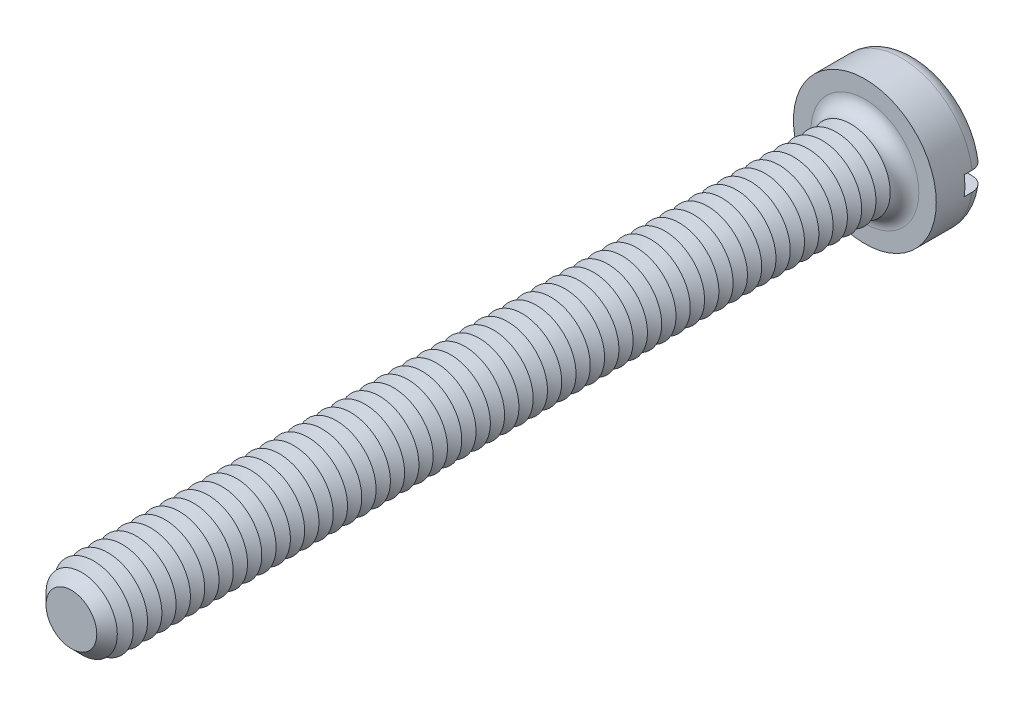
ISO-10303-21;
HEADER;
FILE_DESCRIPTION(('STEP AP214'),'2;1');
FILE_NAME('part.step','',(''),(''),'','','');
FILE_SCHEMA(('AUTOMOTIVE_DESIGN { 1 0 10303 214 1 1 1 1 }'));
ENDSEC;
DATA;
#1=APPLICATION_CONTEXT('core data for automotive mechanical design processes');
#2=APPLICATION_PROTOCOL_DEFINITION('international standard','automotive_design',2000,#1);
#3=PRODUCT_CONTEXT('',#1,'mechanical');
#4=PRODUCT('Part','Part','',(#3));
#5=PRODUCT_RELATED_PRODUCT_CATEGORY('part','',(#4));
#6=PRODUCT_DEFINITION_FORMATION('','',#4);
#7=PRODUCT_DEFINITION_CONTEXT('part definition',#1,'design');
#8=PRODUCT_DEFINITION('design','',#6,#7);
#9=PRODUCT_DEFINITION_SHAPE('','',#8);
#10=(LENGTH_UNIT() NAMED_UNIT(*) SI_UNIT(.MILLI.,.METRE.));
#11=(NAMED_UNIT(*) PLANE_ANGLE_UNIT() SI_UNIT($,.RADIAN.));
#12=(NAMED_UNIT(*) SI_UNIT($,.STERADIAN.) SOLID_ANGLE_UNIT());
#13=UNCERTAINTY_MEASURE_WITH_UNIT(LENGTH_MEASURE(1.E-05),#10,'distance_accuracy_value','');
#14=(GEOMETRIC_REPRESENTATION_CONTEXT(3) GLOBAL_UNCERTAINTY_ASSIGNED_CONTEXT((#13)) GLOBAL_UNIT_ASSIGNED_CONTEXT((#10,
#11,#12)) REPRESENTATION_CONTEXT('',''));
#15=CARTESIAN_POINT('',(0.,0.,0.));
#16=DIRECTION('',(0.,0.,1.));
#17=DIRECTION('',(1.,0.,0.));
#18=AXIS2_PLACEMENT_3D('',#15,#16,#17);
#19=CARTESIAN_POINT('',(0.,0.,-1.6));
#20=DIRECTION('',(0.,0.,1.));
#21=DIRECTION('',(1.,0.,0.));
#22=AXIS2_PLACEMENT_3D('',#19,#20,#21);
#23=PLANE('',#22);
#24=CARTESIAN_POINT('',(0.,0.,-1.6));
#25=DIRECTION('',(0.,0.,1.));
#26=DIRECTION('',(1.,0.,0.));
#27=AXIS2_PLACEMENT_3D('',#24,#25,#26);
#28=CIRCLE('',#27,1.8);
#29=CARTESIAN_POINT('',(-1.77482393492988,0.3,-1.6));
#30=VERTEX_POINT('',#29);
#31=CARTESIAN_POINT('',(1.77482393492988,0.3,-1.6));
#32=VERTEX_POINT('',#31);
#33=EDGE_CURVE('E116',#30,#32,#28,.F.);
#34=ORIENTED_EDGE('',*,*,#33,.T.);
#35=DIRECTION('',(1.,0.,0.));
#36=VECTOR('',#35,1.);
#37=CARTESIAN_POINT('',(-2.25,0.3,-1.6));
#38=LINE('',#37,#36);
#39=EDGE_CURVE('E111',#30,#32,#38,.T.);
#40=ORIENTED_EDGE('',*,*,#39,.F.);
#41=EDGE_LOOP('',(#34,#40));
#42=FACE_BOUND('',#41,.T.);
#43=ADVANCED_FACE('F39',(#42),#23,.F.);
#44=CARTESIAN_POINT('',(0.,0.,-1.15));
#45=DIRECTION('',(0.,0.,1.));
#46=DIRECTION('',(1.,0.,0.));
#47=AXIS2_PLACEMENT_3D('',#44,#45,#46);
#48=TOROIDAL_SURFACE('',#47,1.8,0.45);
#49=CARTESIAN_POINT('',(-2.09367249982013,0.3,-1.4713087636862));
#50=CARTESIAN_POINT('',(-2.07531034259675,0.3,-1.48912990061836));
#51=CARTESIAN_POINT('',(-2.05541605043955,0.3,-1.50540110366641));
#52=CARTESIAN_POINT('',(-2.01315405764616,0.3,-1.53437465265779));
#53=CARTESIAN_POINT('',(-1.99078310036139,0.3,-1.54707221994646));
#54=CARTESIAN_POINT('',(-1.94425163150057,0.3,-1.56853090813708));
#55=CARTESIAN_POINT('',(-1.92009286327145,0.3,-1.57729580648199));
#56=CARTESIAN_POINT('',(-1.8706617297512,0.3,-1.59068015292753));
#57=CARTESIAN_POINT('',(-1.84538964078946,0.3,-1.59530062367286));
#58=CARTESIAN_POINT('',(-1.7942134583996,0.3,-1.60031507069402));
#59=CARTESIAN_POINT('',(-1.76830582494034,0.3,-1.60067291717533));
#60=CARTESIAN_POINT('',(-1.71679040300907,0.3,-1.59707477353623));
#61=CARTESIAN_POINT('',(-1.69118264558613,0.3,-1.59311834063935));
#62=CARTESIAN_POINT('',(-1.64075792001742,0.3,-1.58095464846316));
#63=CARTESIAN_POINT('',(-1.61594989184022,0.3,-1.57271029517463));
#64=CARTESIAN_POINT('',(-1.56806655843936,0.3,-1.55217762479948));
#65=CARTESIAN_POINT('',(-1.54499130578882,0.3,-1.53988918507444));
#66=CARTESIAN_POINT('',(-1.50122413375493,0.3,-1.51158963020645));
#67=CARTESIAN_POINT('',(-1.48053389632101,0.3,-1.49557591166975));
#68=CARTESIAN_POINT('',(-1.44217532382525,0.3,-1.46026359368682));
#69=CARTESIAN_POINT('',(-1.42450683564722,0.3,-1.4409651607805));
#70=CARTESIAN_POINT('',(-1.39293961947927,0.3,-1.39986821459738));
#71=CARTESIAN_POINT('',(-1.37899788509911,0.3,-1.37810275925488));
#72=CARTESIAN_POINT('',(-1.35506190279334,0.3,-1.33249939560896));
#73=CARTESIAN_POINT('',(-1.34506709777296,0.3,-1.30866178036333));
#74=CARTESIAN_POINT('',(-1.3295415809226,0.3,-1.26015137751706));
#75=CARTESIAN_POINT('',(-1.32391771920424,0.3,-1.23550839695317));
#76=CARTESIAN_POINT('',(-1.31696995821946,0.3,-1.18562442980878));
#77=CARTESIAN_POINT('',(-1.31564552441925,0.3,-1.16038351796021));
#78=CARTESIAN_POINT('',(-1.31732714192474,0.3,-1.11049178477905));
#79=CARTESIAN_POINT('',(-1.32025766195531,0.3,-1.08583837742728));
#80=CARTESIAN_POINT('',(-1.3302124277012,0.3,-1.03737369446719));
#81=CARTESIAN_POINT('',(-1.33723664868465,0.3,-1.01356241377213));
#82=CARTESIAN_POINT('',(-1.35515820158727,0.3,-0.967413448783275));
#83=CARTESIAN_POINT('',(-1.36606032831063,0.3,-0.945077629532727));
#84=CARTESIAN_POINT('',(-1.39139351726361,0.3,-0.902507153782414));
#85=CARTESIAN_POINT('',(-1.40582489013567,0.3,-0.882272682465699));
#86=CARTESIAN_POINT('',(-1.43808691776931,0.3,-0.844072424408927));
#87=CARTESIAN_POINT('',(-1.4559757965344,0.3,-0.826155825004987));
#88=CARTESIAN_POINT('',(-1.49445205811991,0.3,-0.793502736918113));
#89=CARTESIAN_POINT('',(-1.51503974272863,0.3,-0.778766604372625));
#90=CARTESIAN_POINT('',(-1.55880475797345,0.3,-0.752571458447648));
#91=CARTESIAN_POINT('',(-1.58202794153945,0.3,-0.741189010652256));
#92=CARTESIAN_POINT('',(-1.63004083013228,0.3,-0.722432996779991));
#93=CARTESIAN_POINT('',(-1.65483064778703,0.3,-0.715059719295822));
#94=CARTESIAN_POINT('',(-1.70558060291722,0.3,-0.704463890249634));
#95=CARTESIAN_POINT('',(-1.73155090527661,0.3,-0.701289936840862));
#96=CARTESIAN_POINT('',(-1.78365633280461,0.3,-0.699350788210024));
#97=CARTESIAN_POINT('',(-1.80979145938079,0.3,-0.700585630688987));
#98=CARTESIAN_POINT('',(-1.86145503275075,0.3,-0.70744393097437));
#99=CARTESIAN_POINT('',(-1.88698403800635,0.3,-0.713063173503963));
#100=CARTESIAN_POINT('',(-1.93672112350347,0.3,-0.728546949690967));
#101=CARTESIAN_POINT('',(-1.96092925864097,0.3,-0.738411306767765));
#102=CARTESIAN_POINT('',(-2.00710191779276,0.3,-0.762015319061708));
#103=CARTESIAN_POINT('',(-2.02908465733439,0.3,-0.775719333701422));
#104=CARTESIAN_POINT('',(-2.0704025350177,0.3,-0.806663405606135));
#105=CARTESIAN_POINT('',(-2.08973782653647,0.3,-0.823903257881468));
#106=CARTESIAN_POINT('',(-2.12497879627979,0.3,-0.861218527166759));
#107=CARTESIAN_POINT('',(-2.1409209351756,0.3,-0.881259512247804));
#108=CARTESIAN_POINT('',(-2.16917502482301,0.3,-0.92375535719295));
#109=CARTESIAN_POINT('',(-2.18148717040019,0.3,-0.946210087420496));
#110=CARTESIAN_POINT('',(-2.20201023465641,0.3,-0.99266079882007));
#111=CARTESIAN_POINT('',(-2.21025973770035,0.3,-1.01663973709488));
#112=CARTESIAN_POINT('',(-2.22258852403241,0.3,-1.06564563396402));
#113=CARTESIAN_POINT('',(-2.22666813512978,0.3,-1.0906725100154));
#114=CARTESIAN_POINT('',(-2.23052418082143,0.3,-1.14090288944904));
#115=CARTESIAN_POINT('',(-2.23032644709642,0.3,-1.16610441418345));
#116=CARTESIAN_POINT('',(-2.22569614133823,0.3,-1.21612212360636));
#117=CARTESIAN_POINT('',(-2.2212625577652,0.3,-1.24093821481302));
#118=CARTESIAN_POINT('',(-2.20829785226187,0.3,-1.2894516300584));
#119=CARTESIAN_POINT('',(-2.19976997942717,0.3,-1.31314982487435));
#120=CARTESIAN_POINT('',(-2.17887390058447,0.3,-1.35876313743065));
#121=CARTESIAN_POINT('',(-2.1665103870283,0.3,-1.3806803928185));
#122=CARTESIAN_POINT('',(-2.14384463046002,0.3,-1.4140108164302));
#123=CARTESIAN_POINT('',(-2.13462949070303,0.3,-1.42617780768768));
#124=CARTESIAN_POINT('',(-2.1150151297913,0.3,-1.44951629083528));
#125=CARTESIAN_POINT('',(-2.10461591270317,0.3,-1.46068778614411));
#126=CARTESIAN_POINT('',(-2.09367249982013,0.3,-1.4713087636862));
#127=B_SPLINE_CURVE_WITH_KNOTS('',3,(#49,#50,#51,#52,#53,#54,#55,#56,#57,#58,#59,#60,#61,#62,
#63,#64,#65,#66,#67,#68,#69,#70,#71,#72,#73,#74,#75,#76,#77,#78,#79,#80,#81,#82,#83,#84,#85,#86,
#87,#88,#89,#90,#91,#92,#93,#94,#95,#96,#97,#98,#99,#100,#101,#102,#103,#104,#105,#106,#107,
#108,#109,#110,#111,#112,#113,#114,#115,#116,#117,#118,#119,#120,#121,#122,#123,#124,#125,#126),
.UNSPECIFIED.,.T.,.F.,(4,2,2,2,2,2,2,2,2,2,2,2,2,2,2,2,2,2,2,2,2,2,2,2,2,2,2,2,2,2,2,2,2,2,2,2,
2,2,4),(0.,0.0767085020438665,0.153519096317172,0.230255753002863,0.306973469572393,
0.384340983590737,0.461716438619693,0.539772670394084,0.617831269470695,0.695944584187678,
0.774053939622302,0.851218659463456,0.928372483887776,1.00383319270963,1.07928451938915,
1.15341274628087,1.22754052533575,1.30176027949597,1.37598656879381,1.45159320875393,
1.52720831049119,1.6044355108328,1.68166826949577,1.75978723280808,1.8379068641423,
1.91595148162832,1.99399285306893,2.07133254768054,2.14866775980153,2.22512456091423,
2.30157725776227,2.3772891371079,2.45299506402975,2.52824391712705,2.60351074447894,
2.67871794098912,2.75383349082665,2.79955010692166,2.84526656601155),.UNSPECIFIED.);
#128=CARTESIAN_POINT('',(-2.22991031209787,0.3,-1.14999999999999));
#129=VERTEX_POINT('',#128);
#130=EDGE_CURVE('E616',#129,#30,#127,.T.);
#131=ORIENTED_EDGE('',*,*,#130,.F.);
#132=CARTESIAN_POINT('',(0.,0.,-1.15));
#133=DIRECTION('',(0.,0.,1.));
#134=DIRECTION('',(1.,0.,0.));
#135=AXIS2_PLACEMENT_3D('',#132,#133,#134);
#136=CIRCLE('',#135,2.25);
#137=CARTESIAN_POINT('',(2.22991031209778,0.3,-1.15));
#138=VERTEX_POINT('',#137);
#139=EDGE_CURVE('E124',#138,#129,#136,.T.);
#140=ORIENTED_EDGE('',*,*,#139,.F.);
#141=CARTESIAN_POINT('',(1.39325818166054,0.3,-1.39903402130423));
#142=CARTESIAN_POINT('',(1.40771723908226,0.3,-1.42030595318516));
#143=CARTESIAN_POINT('',(1.4240122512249,0.3,-1.4403555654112));
#144=CARTESIAN_POINT('',(1.45976320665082,0.3,-1.4774406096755));
#145=CARTESIAN_POINT('',(1.47922380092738,0.3,-1.49447152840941));
#146=CARTESIAN_POINT('',(1.5206923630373,0.3,-1.52502510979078));
#147=CARTESIAN_POINT('',(1.54269721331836,0.3,-1.53855200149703));
#148=CARTESIAN_POINT('',(1.58863815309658,0.3,-1.56176272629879));
#149=CARTESIAN_POINT('',(1.61257369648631,0.3,-1.57144764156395));
#150=CARTESIAN_POINT('',(1.66199169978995,0.3,-1.58680804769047));
#151=CARTESIAN_POINT('',(1.68748839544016,0.3,-1.59243778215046));
#152=CARTESIAN_POINT('',(1.73906656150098,0.3,-1.59934902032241));
#153=CARTESIAN_POINT('',(1.76514807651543,0.3,-1.60063019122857));
#154=CARTESIAN_POINT('',(1.81721740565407,0.3,-1.59879130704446));
#155=CARTESIAN_POINT('',(1.84320486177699,0.3,-1.59566102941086));
#156=CARTESIAN_POINT('',(1.89427635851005,0.3,-1.58504931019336));
#157=CARTESIAN_POINT('',(1.91936042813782,0.3,-1.57756800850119));
#158=CARTESIAN_POINT('',(1.9677137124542,0.3,-1.55851722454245));
#159=CARTESIAN_POINT('',(1.99099484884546,0.3,-1.5469780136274));
#160=CARTESIAN_POINT('',(2.03525897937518,0.3,-1.52011224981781));
#161=CARTESIAN_POINT('',(2.05624211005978,0.3,-1.50478592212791));
#162=CARTESIAN_POINT('',(2.09506403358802,0.3,-1.47096472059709));
#163=CARTESIAN_POINT('',(2.11293536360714,0.3,-1.45250719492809));
#164=CARTESIAN_POINT('',(2.14528563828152,0.3,-1.41282609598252));
#165=CARTESIAN_POINT('',(2.15976477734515,0.3,-1.39160268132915));
#166=CARTESIAN_POINT('',(2.18476262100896,0.3,-1.34723254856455));
#167=CARTESIAN_POINT('',(2.19532119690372,0.3,-1.32410828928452));
#168=CARTESIAN_POINT('',(2.21237438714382,0.3,-1.27640693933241));
#169=CARTESIAN_POINT('',(2.21886918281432,0.3,-1.25182991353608));
#170=CARTESIAN_POINT('',(2.2275687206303,0.3,-1.20210937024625));
#171=CARTESIAN_POINT('',(2.22980376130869,0.3,-1.17697115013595));
#172=CARTESIAN_POINT('',(2.23000940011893,0.3,-1.12667754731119));
#173=CARTESIAN_POINT('',(2.22798009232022,0.3,-1.10152216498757));
#174=CARTESIAN_POINT('',(2.21972856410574,0.3,-1.05197773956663));
#175=CARTESIAN_POINT('',(2.21351744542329,0.3,-1.02758684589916));
#176=CARTESIAN_POINT('',(2.19709696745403,0.3,-0.980190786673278));
#177=CARTESIAN_POINT('',(2.18688760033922,0.3,-0.957185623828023));
#178=CARTESIAN_POINT('',(2.1627435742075,0.3,-0.913157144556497));
#179=CARTESIAN_POINT('',(2.14880093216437,0.3,-0.892138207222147));
#180=CARTESIAN_POINT('',(2.11760640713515,0.3,-0.852719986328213));
#181=CARTESIAN_POINT('',(2.10035443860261,0.3,-0.834320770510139));
#182=CARTESIAN_POINT('',(2.06291254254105,0.3,-0.80052923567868));
#183=CARTESIAN_POINT('',(2.04270386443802,0.3,-0.785157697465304));
#184=CARTESIAN_POINT('',(2.0000139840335,0.3,-0.757986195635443));
#185=CARTESIAN_POINT('',(1.97753267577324,0.3,-0.746186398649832));
#186=CARTESIAN_POINT('',(1.93069507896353,0.3,-0.726364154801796));
#187=CARTESIAN_POINT('',(1.90632219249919,0.3,-0.718380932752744));
#188=CARTESIAN_POINT('',(1.85658993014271,0.3,-0.706569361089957));
#189=CARTESIAN_POINT('',(1.83123049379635,0.3,-0.702741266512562));
#190=CARTESIAN_POINT('',(1.77994107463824,0.3,-0.699306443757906));
#191=CARTESIAN_POINT('',(1.75400788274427,0.3,-0.69974759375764));
#192=CARTESIAN_POINT('',(1.70257608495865,0.3,-0.704939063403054));
#193=CARTESIAN_POINT('',(1.67707750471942,0.3,-0.709689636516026));
#194=CARTESIAN_POINT('',(1.62701662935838,0.3,-0.723419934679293));
#195=CARTESIAN_POINT('',(1.60246387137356,0.3,-0.732434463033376));
#196=CARTESIAN_POINT('',(1.55521886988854,0.3,-0.754458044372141));
#197=CARTESIAN_POINT('',(1.53252668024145,0.3,-0.76746721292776));
#198=CARTESIAN_POINT('',(1.48966925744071,0.3,-0.797124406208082));
#199=CARTESIAN_POINT('',(1.46950315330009,0.3,-0.813771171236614));
#200=CARTESIAN_POINT('',(1.43229728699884,0.3,-0.850255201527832));
#201=CARTESIAN_POINT('',(1.41525734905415,0.3,-0.870092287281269));
#202=CARTESIAN_POINT('',(1.3850470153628,0.3,-0.912123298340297));
#203=CARTESIAN_POINT('',(1.37182821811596,0.3,-0.934282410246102));
#204=CARTESIAN_POINT('',(1.34939737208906,0.3,-0.980542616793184));
#205=CARTESIAN_POINT('',(1.34018456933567,0.3,-1.00464334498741));
#206=CARTESIAN_POINT('',(1.32624172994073,0.3,-1.05352472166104));
#207=CARTESIAN_POINT('',(1.32141599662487,0.3,-1.07827808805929));
#208=CARTESIAN_POINT('',(1.31606478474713,0.3,-1.12825155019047));
#209=CARTESIAN_POINT('',(1.31553992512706,0.3,-1.15347171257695));
#210=CARTESIAN_POINT('',(1.31878307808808,0.3,-1.20323022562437));
#211=CARTESIAN_POINT('',(1.32248353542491,0.3,-1.22777305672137));
#212=CARTESIAN_POINT('',(1.33394086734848,0.3,-1.27586981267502));
#213=CARTESIAN_POINT('',(1.34169274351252,0.3,-1.2994249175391));
#214=CARTESIAN_POINT('',(1.35704250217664,0.3,-1.33561898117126));
#215=CARTESIAN_POINT('',(1.36341395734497,0.3,-1.34879219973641));
#216=CARTESIAN_POINT('',(1.37741190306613,0.3,-1.37445328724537));
#217=CARTESIAN_POINT('',(1.38503837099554,0.3,-1.38694116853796));
#218=CARTESIAN_POINT('',(1.39325818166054,0.3,-1.39903402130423));
#219=B_SPLINE_CURVE_WITH_KNOTS('',3,(#141,#142,#143,#144,#145,#146,#147,#148,#149,#150,#151,
#152,#153,#154,#155,#156,#157,#158,#159,#160,#161,#162,#163,#164,#165,#166,#167,#168,#169,#170,
#171,#172,#173,#174,#175,#176,#177,#178,#179,#180,#181,#182,#183,#184,#185,#186,#187,#188,#189,
#190,#191,#192,#193,#194,#195,#196,#197,#198,#199,#200,#201,#202,#203,#204,#205,#206,#207,#208,
#209,#210,#211,#212,#213,#214,#215,#216,#217,#218),.UNSPECIFIED.,.T.,.F.,(4,2,2,2,2,2,2,2,2,2,2,
2,2,2,2,2,2,2,2,2,2,2,2,2,2,2,2,2,2,2,2,2,2,2,2,2,2,2,4),(0.,0.0771077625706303,
0.154329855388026,0.231458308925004,0.308565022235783,0.386528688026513,0.464498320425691,
0.542648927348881,0.620797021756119,0.698374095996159,0.77594655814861,0.852651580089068,
0.929352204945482,1.00524992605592,1.08114426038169,1.15649673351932,1.2318475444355,
1.30699910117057,1.38215080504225,1.45746451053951,1.53278016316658,1.60859599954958,
1.68441537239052,1.76099806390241,1.83758545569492,1.91503273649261,1.99248457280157,
2.07057979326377,2.14867727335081,2.22674775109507,2.30481383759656,2.38184276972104,
2.45885719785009,2.53414829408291,2.6094502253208,2.68356487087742,2.75758829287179,
2.80142397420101,2.84525886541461),.UNSPECIFIED.);
#220=EDGE_CURVE('E618',#32,#138,#219,.T.);
#221=ORIENTED_EDGE('',*,*,#220,.F.);
#222=ORIENTED_EDGE('',*,*,#33,.F.);
#223=EDGE_LOOP('',(#131,#140,#221,#222));
#224=FACE_BOUND('',#223,.T.);
#225=ADVANCED_FACE('F600',(#224),#48,.T.);
#226=CARTESIAN_POINT('',(0.,0.,-1.6));
#227=DIRECTION('',(0.,0.,1.));
#228=DIRECTION('',(1.,0.,0.));
#229=AXIS2_PLACEMENT_3D('',#226,#227,#228);
#230=CYLINDRICAL_SURFACE('',#229,2.25);
#231=DIRECTION('',(0.,0.,1.));
#232=VECTOR('',#231,1.);
#233=CARTESIAN_POINT('',(2.22991031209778,0.3,-1.6));
#234=LINE('',#233,#232);
#235=CARTESIAN_POINT('',(2.22991031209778,0.3,-0.9));
#236=VERTEX_POINT('',#235);
#237=EDGE_CURVE('E633',#138,#236,#234,.T.);
#238=ORIENTED_EDGE('',*,*,#237,.F.);
#239=ORIENTED_EDGE('',*,*,#139,.T.);
#240=DIRECTION('',(0.,0.,1.));
#241=VECTOR('',#240,1.);
#242=CARTESIAN_POINT('',(-2.22991031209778,0.3,-1.6));
#243=LINE('',#242,#241);
#244=CARTESIAN_POINT('',(-2.22991031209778,0.3,-0.9));
#245=VERTEX_POINT('',#244);
#246=EDGE_CURVE('E63',#245,#129,#243,.F.);
#247=ORIENTED_EDGE('',*,*,#246,.F.);
#248=CARTESIAN_POINT('',(0.,0.,-0.9));
#249=DIRECTION('',(0.,0.,-1.));
#250=DIRECTION('',(-1.,0.,0.));
#251=AXIS2_PLACEMENT_3D('',#248,#249,#250);
#252=CIRCLE('',#251,2.25);
#253=CARTESIAN_POINT('',(-2.22991031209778,-0.3,-0.9));
#254=VERTEX_POINT('',#253);
#255=EDGE_CURVE('E43',#245,#254,#252,.F.);
#256=ORIENTED_EDGE('',*,*,#255,.T.);
#257=DIRECTION('',(0.,0.,1.));
#258=VECTOR('',#257,1.);
#259=CARTESIAN_POINT('',(-2.22991031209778,-0.3,-1.6));
#260=LINE('',#259,#258);
#261=CARTESIAN_POINT('',(-2.22991031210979,-0.3,-1.15000000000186));
#262=VERTEX_POINT('',#261);
#263=EDGE_CURVE('E630',#262,#254,#260,.T.);
#264=ORIENTED_EDGE('',*,*,#263,.F.);
#265=CARTESIAN_POINT('',(2.22991031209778,-0.3,-1.15));
#266=VERTEX_POINT('',#265);
#267=EDGE_CURVE('E126',#262,#266,#136,.T.);
#268=ORIENTED_EDGE('',*,*,#267,.T.);
#269=DIRECTION('',(0.,0.,1.));
#270=VECTOR('',#269,1.);
#271=CARTESIAN_POINT('',(2.22991031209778,-0.3,-1.6));
#272=LINE('',#271,#270);
#273=CARTESIAN_POINT('',(2.22991031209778,-0.3,-0.9));
#274=VERTEX_POINT('',#273);
#275=EDGE_CURVE('E55',#274,#266,#272,.F.);
#276=ORIENTED_EDGE('',*,*,#275,.F.);
#277=EDGE_CURVE('E11',#274,#236,#252,.F.);
#278=ORIENTED_EDGE('',*,*,#277,.T.);
#279=EDGE_LOOP('',(#238,#239,#247,#256,#264,#268,#276,#278));
#280=FACE_BOUND('',#279,.T.);
#281=CARTESIAN_POINT('',(0.,0.,0.));
#282=DIRECTION('',(0.,0.,1.));
#283=DIRECTION('',(1.,0.,0.));
#284=AXIS2_PLACEMENT_3D('',#281,#282,#283);
#285=CIRCLE('',#284,2.25);
#286=CARTESIAN_POINT('',(2.25,0.,0.));
#287=VERTEX_POINT('',#286);
#288=EDGE_CURVE('E636',#287,#287,#285,.T.);
#289=ORIENTED_EDGE('',*,*,#288,.F.);
#290=EDGE_LOOP('',(#289));
#291=FACE_BOUND('',#290,.T.);
#292=ADVANCED_FACE('F596',(#280,#291),#230,.T.);
#293=CARTESIAN_POINT('',(1.77482393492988,-0.3,-1.6));
#294=VERTEX_POINT('',#293);
#295=CARTESIAN_POINT('',(-1.77482393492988,-0.3,-1.6));
#296=VERTEX_POINT('',#295);
#297=EDGE_CURVE('E109',#294,#296,#28,.F.);
#298=ORIENTED_EDGE('',*,*,#297,.T.);
#299=DIRECTION('',(-1.,0.,0.));
#300=VECTOR('',#299,1.);
#301=CARTESIAN_POINT('',(-2.25,-0.3,-1.6));
#302=LINE('',#301,#300);
#303=EDGE_CURVE('E96',#294,#296,#302,.T.);
#304=ORIENTED_EDGE('',*,*,#303,.F.);
#305=EDGE_LOOP('',(#298,#304));
#306=FACE_BOUND('',#305,.T.);
#307=ADVANCED_FACE('F108',(#306),#23,.F.);
#308=CARTESIAN_POINT('',(0.,0.,0.));
#309=DIRECTION('',(0.,0.,1.));
#310=DIRECTION('',(1.,0.,0.));
#311=AXIS2_PLACEMENT_3D('',#308,#309,#310);
#312=PLANE('',#311);
#313=CARTESIAN_POINT('',(0.,0.,0.));
#314=DIRECTION('',(0.,0.,1.));
#315=DIRECTION('',(1.,0.,0.));
#316=AXIS2_PLACEMENT_3D('',#313,#314,#315);
#317=CIRCLE('',#316,1.7);
#318=CARTESIAN_POINT('',(1.7,0.,0.));
#319=VERTEX_POINT('',#318);
#320=EDGE_CURVE('E115',#319,#319,#317,.F.);
#321=ORIENTED_EDGE('',*,*,#320,.T.);
#322=EDGE_LOOP('',(#321));
#323=FACE_BOUND('',#322,.T.);
#324=ORIENTED_EDGE('',*,*,#288,.T.);
#325=EDGE_LOOP('',(#324));
#326=FACE_BOUND('',#325,.T.);
#327=ADVANCED_FACE('F595',(#323,#326),#312,.T.);
#328=CARTESIAN_POINT('',(-2.09367249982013,-0.3,-1.4713087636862));
#329=CARTESIAN_POINT('',(-2.11176539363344,-0.3,-1.45374579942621));
#330=CARTESIAN_POINT('',(-2.1283968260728,-0.3,-1.43465254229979));
#331=CARTESIAN_POINT('',(-2.15823692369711,-0.3,-1.39393307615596));
#332=CARTESIAN_POINT('',(-2.17144184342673,-0.3,-1.37230413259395));
#333=CARTESIAN_POINT('',(-2.19402281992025,-0.3,-1.32713362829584));
#334=CARTESIAN_POINT('',(-2.20339951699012,-0.3,-1.30359238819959));
#335=CARTESIAN_POINT('',(-2.21804409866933,-0.3,-1.25527081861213));
#336=CARTESIAN_POINT('',(-2.22331295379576,-0.3,-1.23049078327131));
#337=CARTESIAN_POINT('',(-2.22957448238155,-0.3,-1.18050893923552));
#338=CARTESIAN_POINT('',(-2.23058617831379,-0.3,-1.15530951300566));
#339=CARTESIAN_POINT('',(-2.22835535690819,-0.3,-1.10509920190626));
#340=CARTESIAN_POINT('',(-2.22511277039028,-0.3,-1.08008832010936));
#341=CARTESIAN_POINT('',(-2.21448018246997,-0.3,-1.03101646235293));
#342=CARTESIAN_POINT('',(-2.20709836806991,-0.3,-1.00695371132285));
#343=CARTESIAN_POINT('',(-2.18841075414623,-0.3,-0.960404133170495));
#344=CARTESIAN_POINT('',(-2.17710493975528,-0.3,-0.937917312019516));
#345=CARTESIAN_POINT('',(-2.15086234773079,-0.3,-0.895085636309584));
#346=CARTESIAN_POINT('',(-2.13591537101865,-0.3,-0.874747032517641));
#347=CARTESIAN_POINT('',(-2.1028415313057,-0.3,-0.836845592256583));
#348=CARTESIAN_POINT('',(-2.08471458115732,-0.3,-0.819282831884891));
#349=CARTESIAN_POINT('',(-2.0456590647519,-0.3,-0.78729174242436));
#350=CARTESIAN_POINT('',(-2.0247112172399,-0.3,-0.772886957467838));
#351=CARTESIAN_POINT('',(-1.98071452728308,-0.3,-0.747756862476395));
#352=CARTESIAN_POINT('',(-1.95766557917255,-0.3,-0.737031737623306));
#353=CARTESIAN_POINT('',(-1.90986554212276,-0.3,-0.71944451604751));
#354=CARTESIAN_POINT('',(-1.88509923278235,-0.3,-0.712623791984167));
#355=CARTESIAN_POINT('',(-1.83477837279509,-0.3,-0.703186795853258));
#356=CARTESIAN_POINT('',(-1.80922377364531,-0.3,-0.700570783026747));
#357=CARTESIAN_POINT('',(-1.75774893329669,-0.3,-0.699591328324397));
#358=CARTESIAN_POINT('',(-1.73182778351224,-0.3,-0.701275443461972));
#359=CARTESIAN_POINT('',(-1.68062744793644,-0.3,-0.708937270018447));
#360=CARTESIAN_POINT('',(-1.65534829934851,-0.3,-0.714915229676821));
#361=CARTESIAN_POINT('',(-1.6059539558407,-0.3,-0.731056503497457));
#362=CARTESIAN_POINT('',(-1.58184881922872,-0.3,-0.741250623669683));
#363=CARTESIAN_POINT('',(-1.53569497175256,-0.3,-0.765548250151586));
#364=CARTESIAN_POINT('',(-1.51364629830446,-0.3,-0.779651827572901));
#365=CARTESIAN_POINT('',(-1.47229470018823,-0.3,-0.811355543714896));
#366=CARTESIAN_POINT('',(-1.45298625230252,-0.3,-0.828948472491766));
#367=CARTESIAN_POINT('',(-1.41765142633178,-0.3,-0.867170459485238));
#368=CARTESIAN_POINT('',(-1.40162480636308,-0.3,-0.887799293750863));
#369=CARTESIAN_POINT('',(-1.37358365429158,-0.3,-0.93118317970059));
#370=CARTESIAN_POINT('',(-1.3615121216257,-0.3,-0.953901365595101));
#371=CARTESIAN_POINT('',(-1.34145576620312,-0.3,-1.00107529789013));
#372=CARTESIAN_POINT('',(-1.33347032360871,-0.3,-1.02553078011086));
#373=CARTESIAN_POINT('',(-1.32199536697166,-0.3,-1.07489401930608));
#374=CARTESIAN_POINT('',(-1.31840873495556,-0.3,-1.09977921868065));
#375=CARTESIAN_POINT('',(-1.31553052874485,-0.3,-1.1497957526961));
#376=CARTESIAN_POINT('',(-1.31623852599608,-0.3,-1.17492706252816));
#377=CARTESIAN_POINT('',(-1.32188368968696,-0.3,-1.22435119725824));
#378=CARTESIAN_POINT('',(-1.32676151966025,-0.3,-1.24865083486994));
#379=CARTESIAN_POINT('',(-1.34050334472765,-0.3,-1.29609421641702));
#380=CARTESIAN_POINT('',(-1.34936742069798,-0.3,-1.31923793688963));
#381=CARTESIAN_POINT('',(-1.37086295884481,-0.3,-1.36387796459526));
#382=CARTESIAN_POINT('',(-1.38351729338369,-0.3,-1.38536324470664));
#383=CARTESIAN_POINT('',(-1.41218367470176,-0.3,-1.42596199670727));
#384=CARTESIAN_POINT('',(-1.42819606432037,-0.3,-1.44507522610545));
#385=CARTESIAN_POINT('',(-1.46347664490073,-0.3,-1.48081087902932));
#386=CARTESIAN_POINT('',(-1.48280543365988,-0.3,-1.49737347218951));
#387=CARTESIAN_POINT('',(-1.5239232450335,-0.3,-1.52709508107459));
#388=CARTESIAN_POINT('',(-1.54571253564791,-0.3,-1.54025372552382));
#389=CARTESIAN_POINT('',(-1.59160097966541,-0.3,-1.56305446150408));
#390=CARTESIAN_POINT('',(-1.61573734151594,-0.3,-1.57262172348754));
#391=CARTESIAN_POINT('',(-1.66526504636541,-0.3,-1.58760700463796));
#392=CARTESIAN_POINT('',(-1.69065641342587,-0.3,-1.59302494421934));
#393=CARTESIAN_POINT('',(-1.74220154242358,-0.3,-1.59958446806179));
#394=CARTESIAN_POINT('',(-1.7683598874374,-0.3,-1.60069012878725));
#395=CARTESIAN_POINT('',(-1.82049681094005,-0.3,-1.59847888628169));
#396=CARTESIAN_POINT('',(-1.8464753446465,-0.3,-1.59516091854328));
#397=CARTESIAN_POINT('',(-1.89742078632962,-0.3,-1.58419269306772));
#398=CARTESIAN_POINT('',(-1.92239041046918,-0.3,-1.57655503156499));
#399=CARTESIAN_POINT('',(-1.97064988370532,-0.3,-1.55715679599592));
#400=CARTESIAN_POINT('',(-1.99394179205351,-0.3,-1.54540138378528));
#401=CARTESIAN_POINT('',(-2.03003215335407,-0.3,-1.52312594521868));
#402=CARTESIAN_POINT('',(-2.04354254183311,-0.3,-1.51373809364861));
#403=CARTESIAN_POINT('',(-2.06946640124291,-0.3,-1.49355310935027));
#404=CARTESIAN_POINT('',(-2.08187987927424,-0.3,-1.48275598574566));
#405=CARTESIAN_POINT('',(-2.09367249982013,-0.3,-1.4713087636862));
#406=B_SPLINE_CURVE_WITH_KNOTS('',3,(#328,#329,#330,#331,#332,#333,#334,#335,#336,#337,#338,
#339,#340,#341,#342,#343,#344,#345,#346,#347,#348,#349,#350,#351,#352,#353,#354,#355,#356,#357,
#358,#359,#360,#361,#362,#363,#364,#365,#366,#367,#368,#369,#370,#371,#372,#373,#374,#375,#376,
#377,#378,#379,#380,#381,#382,#383,#384,#385,#386,#387,#388,#389,#390,#391,#392,#393,#394,#395,
#396,#397,#398,#399,#400,#401,#402,#403,#404,#405),.UNSPECIFIED.,.T.,.F.,(4,2,2,2,2,2,2,2,2,2,2,
2,2,2,2,2,2,2,2,2,2,2,2,2,2,2,2,2,2,2,2,2,2,2,2,2,2,2,4),(0.,0.0755864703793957,
0.151255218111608,0.226911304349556,0.302549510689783,0.377849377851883,0.453150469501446,
0.528303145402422,0.603456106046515,0.67882204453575,0.754190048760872,0.83010216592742,
0.906018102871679,0.982724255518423,1.05943513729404,1.13699806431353,1.21456547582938,
1.29270994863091,1.37085584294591,1.44884191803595,1.52682224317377,1.60362346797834,
1.68041303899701,1.75547480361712,1.83052907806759,1.90453278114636,1.97853798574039,
2.05299909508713,2.12746781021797,2.20347986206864,2.27950020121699,2.3570265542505,
2.43455439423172,2.5127267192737,2.59091785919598,2.66888216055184,2.74674907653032,
2.79601528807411,2.84528118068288),.UNSPECIFIED.);
#407=EDGE_CURVE('E103',#296,#262,#406,.T.);
#408=ORIENTED_EDGE('',*,*,#407,.F.);
#409=ORIENTED_EDGE('',*,*,#297,.F.);
#410=CARTESIAN_POINT('',(1.39325818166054,-0.3,-1.39903402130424));
#411=CARTESIAN_POINT('',(1.37924349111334,-0.3,-1.37841200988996));
#412=CARTESIAN_POINT('',(1.36693374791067,-0.3,-1.35661225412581));
#413=CARTESIAN_POINT('',(1.34612289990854,-0.3,-1.31124547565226));
#414=CARTESIAN_POINT('',(1.33762533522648,-0.3,-1.28767683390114));
#415=CARTESIAN_POINT('',(1.32472877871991,-0.3,-1.23943261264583));
#416=CARTESIAN_POINT('',(1.3203309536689,-0.3,-1.21475672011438));
#417=CARTESIAN_POINT('',(1.31579198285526,-0.3,-1.16502199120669));
#418=CARTESIAN_POINT('',(1.31564980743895,-0.3,-1.13996324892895));
#419=CARTESIAN_POINT('',(1.31960322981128,-0.3,-1.09044336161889));
#420=CARTESIAN_POINT('',(1.32365524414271,-0.3,-1.06597872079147));
#421=CARTESIAN_POINT('',(1.33579339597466,-0.3,-1.01807218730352));
#422=CARTESIAN_POINT('',(1.34387971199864,-0.3,-0.994630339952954));
#423=CARTESIAN_POINT('',(1.36386460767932,-0.3,-0.949319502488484));
#424=CARTESIAN_POINT('',(1.37577869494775,-0.3,-0.92745736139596));
#425=CARTESIAN_POINT('',(1.40303929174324,-0.3,-0.885990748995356));
#426=CARTESIAN_POINT('',(1.41838612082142,-0.3,-0.866386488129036));
#427=CARTESIAN_POINT('',(1.45239955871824,-0.3,-0.829572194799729));
#428=CARTESIAN_POINT('',(1.47112624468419,-0.3,-0.812417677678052));
#429=CARTESIAN_POINT('',(1.51114353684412,-0.3,-0.78141873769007));
#430=CARTESIAN_POINT('',(1.53243442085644,-0.3,-0.767574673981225));
#431=CARTESIAN_POINT('',(1.57744959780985,-0.3,-0.743302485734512));
#432=CARTESIAN_POINT('',(1.6012148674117,-0.3,-0.732950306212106));
#433=CARTESIAN_POINT('',(1.65013556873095,-0.3,-0.71633816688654));
#434=CARTESIAN_POINT('',(1.67529109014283,-0.3,-0.710078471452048));
#435=CARTESIAN_POINT('',(1.72654223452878,-0.3,-0.701786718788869));
#436=CARTESIAN_POINT('',(1.75264462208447,-0.3,-0.699796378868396));
#437=CARTESIAN_POINT('',(1.80481283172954,-0.3,-0.700236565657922));
#438=CARTESIAN_POINT('',(1.83087865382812,-0.3,-0.702667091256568));
#439=CARTESIAN_POINT('',(1.88216421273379,-0.3,-0.71188843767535));
#440=CARTESIAN_POINT('',(1.90738581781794,-0.3,-0.718668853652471));
#441=CARTESIAN_POINT('',(1.95631449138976,-0.3,-0.736408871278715));
#442=CARTESIAN_POINT('',(1.98002162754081,-0.3,-0.747368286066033));
#443=CARTESIAN_POINT('',(2.02500221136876,-0.3,-0.773046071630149));
#444=CARTESIAN_POINT('',(2.04629687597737,-0.3,-0.78772726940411));
#445=CARTESIAN_POINT('',(2.08608258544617,-0.3,-0.820494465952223));
#446=CARTESIAN_POINT('',(2.10457379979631,-0.3,-0.838580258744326));
#447=CARTESIAN_POINT('',(2.1380062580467,-0.3,-0.877422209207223));
#448=CARTESIAN_POINT('',(2.15298532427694,-0.3,-0.898145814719));
#449=CARTESIAN_POINT('',(2.17921311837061,-0.3,-0.941832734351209));
#450=CARTESIAN_POINT('',(2.19046204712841,-0.3,-0.964795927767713));
#451=CARTESIAN_POINT('',(2.20880507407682,-0.3,-1.01207981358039));
#452=CARTESIAN_POINT('',(2.2159367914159,-0.3,-1.0363859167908));
#453=CARTESIAN_POINT('',(2.22599386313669,-0.3,-1.08585317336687));
#454=CARTESIAN_POINT('',(2.22891936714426,-0.3,-1.11101429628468));
#455=CARTESIAN_POINT('',(2.23047255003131,-0.3,-1.16133395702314));
#456=CARTESIAN_POINT('',(2.22912306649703,-0.3,-1.18649179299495));
#457=CARTESIAN_POINT('',(2.22221641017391,-0.3,-1.236222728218));
#458=CARTESIAN_POINT('',(2.21665928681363,-0.3,-1.26079583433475));
#459=CARTESIAN_POINT('',(2.20150655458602,-0.3,-1.30864604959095));
#460=CARTESIAN_POINT('',(2.19191347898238,-0.3,-1.3319239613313));
#461=CARTESIAN_POINT('',(2.16897085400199,-0.3,-1.37654778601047));
#462=CARTESIAN_POINT('',(2.15562126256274,-0.3,-1.39789367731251));
#463=CARTESIAN_POINT('',(2.12549147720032,-0.3,-1.43814583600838));
#464=CARTESIAN_POINT('',(2.1086973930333,-0.3,-1.45704170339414));
#465=CARTESIAN_POINT('',(2.07219852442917,-0.3,-1.491773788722));
#466=CARTESIAN_POINT('',(2.0524936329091,-0.3,-1.50760989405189));
#467=CARTESIAN_POINT('',(2.01056127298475,-0.3,-1.53591667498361));
#468=CARTESIAN_POINT('',(1.98831430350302,-0.3,-1.54835845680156));
#469=CARTESIAN_POINT('',(1.94206418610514,-0.3,-1.5693763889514));
#470=CARTESIAN_POINT('',(1.91806093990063,-0.3,-1.57795232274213));
#471=CARTESIAN_POINT('',(1.86869953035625,-0.3,-1.5910955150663));
#472=CARTESIAN_POINT('',(1.84332941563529,-0.3,-1.59561788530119));
#473=CARTESIAN_POINT('',(1.7921914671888,-0.3,-1.60038767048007));
#474=CARTESIAN_POINT('',(1.76642362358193,-0.3,-1.60063497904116));
#475=CARTESIAN_POINT('',(1.71493241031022,-0.3,-1.59684388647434));
#476=CARTESIAN_POINT('',(1.6892123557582,-0.3,-1.59276040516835));
#477=CARTESIAN_POINT('',(1.63880694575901,-0.3,-1.58035661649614));
#478=CARTESIAN_POINT('',(1.61412189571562,-0.3,-1.5720350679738));
#479=CARTESIAN_POINT('',(1.56635013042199,-0.3,-1.55132424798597));
#480=CARTESIAN_POINT('',(1.54327365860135,-0.3,-1.53891136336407));
#481=CARTESIAN_POINT('',(1.49956705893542,-0.3,-1.51037484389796));
#482=CARTESIAN_POINT('',(1.478934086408,-0.3,-1.49425558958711));
#483=CARTESIAN_POINT('',(1.44732882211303,-0.3,-1.46489751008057));
#484=CARTESIAN_POINT('',(1.43548118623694,-0.3,-1.45258668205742));
#485=CARTESIAN_POINT('',(1.41324217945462,-0.3,-1.42671249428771));
#486=CARTESIAN_POINT('',(1.40285079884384,-0.3,-1.41314914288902));
#487=CARTESIAN_POINT('',(1.39325818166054,-0.3,-1.39903402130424));
#488=B_SPLINE_CURVE_WITH_KNOTS('',3,(#410,#411,#412,#413,#414,#415,#416,#417,#418,#419,#420,
#421,#422,#423,#424,#425,#426,#427,#428,#429,#430,#431,#432,#433,#434,#435,#436,#437,#438,#439,
#440,#441,#442,#443,#444,#445,#446,#447,#448,#449,#450,#451,#452,#453,#454,#455,#456,#457,#458,
#459,#460,#461,#462,#463,#464,#465,#466,#467,#468,#469,#470,#471,#472,#473,#474,#475,#476,#477,
#478,#479,#480,#481,#482,#483,#484,#485,#486,#487),.UNSPECIFIED.,.T.,.F.,(4,2,2,2,2,2,2,2,2,2,2,
2,2,2,2,2,2,2,2,2,2,2,2,2,2,2,2,2,2,2,2,2,2,2,2,2,2,2,4),(0.,0.0747398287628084,
0.149548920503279,0.224379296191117,0.29919156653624,0.373234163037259,0.447280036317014,
0.521629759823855,0.595986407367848,0.671825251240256,0.747672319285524,0.825076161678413,
0.902485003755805,0.980646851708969,1.05880868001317,1.13678424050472,1.21475631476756,
1.29197834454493,1.36919570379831,1.44553881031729,1.52187780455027,1.59750777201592,
1.67313504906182,1.74835899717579,1.82358206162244,1.89875798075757,1.97393474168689,
2.04942084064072,2.12490971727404,2.20102244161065,2.27713942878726,2.35408926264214,
2.43104101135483,2.50880170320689,2.58658518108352,2.66482568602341,2.74297419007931,
2.79413160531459,2.84528867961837),.UNSPECIFIED.);
#489=EDGE_CURVE('E92',#266,#294,#488,.T.);
#490=ORIENTED_EDGE('',*,*,#489,.F.);
#491=ORIENTED_EDGE('',*,*,#267,.F.);
#492=EDGE_LOOP('',(#408,#409,#490,#491));
#493=FACE_BOUND('',#492,.T.);
#494=ADVANCED_FACE('F113',(#493),#48,.T.);
#495=CARTESIAN_POINT('',(0.,0.,0.449999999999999));
#496=DIRECTION('',(0.,0.,1.));
#497=DIRECTION('',(1.,0.,0.));
#498=AXIS2_PLACEMENT_3D('',#495,#496,#497);
#499=TOROIDAL_SURFACE('',#498,1.7,0.45);
#500=ORIENTED_EDGE('',*,*,#320,.F.);
#501=EDGE_LOOP('',(#500));
#502=FACE_BOUND('',#501,.T.);
#503=CARTESIAN_POINT('',(0.,0.,0.449999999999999));
#504=DIRECTION('',(0.,0.,-1.));
#505=DIRECTION('',(-1.,0.,0.));
#506=AXIS2_PLACEMENT_3D('',#503,#504,#505);
#507=CIRCLE('',#506,1.25);
#508=CARTESIAN_POINT('',(-1.25,0.,0.449999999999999));
#509=VERTEX_POINT('',#508);
#510=EDGE_CURVE('E641',#509,#509,#507,.T.);
#511=ORIENTED_EDGE('',*,*,#510,.T.);
#512=EDGE_LOOP('',(#511));
#513=FACE_BOUND('',#512,.T.);
#514=ADVANCED_FACE('F588',(#502,#513),#499,.F.);
#515=CARTESIAN_POINT('',(0.,0.,0.674999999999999));
#516=DIRECTION('',(0.,0.,-1.));
#517=DIRECTION('',(-1.,0.,0.));
#518=AXIS2_PLACEMENT_3D('',#515,#516,#517);
#519=CONICAL_SURFACE('',#518,0.860288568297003,1.0471975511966);
#520=ORIENTED_EDGE('',*,*,#510,.F.);
#521=EDGE_LOOP('',(#520));
#522=FACE_BOUND('',#521,.T.);
#523=CARTESIAN_POINT('',(0.,0.,0.674999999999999));
#524=DIRECTION('',(0.,0.,-1.));
#525=DIRECTION('',(-1.,0.,0.));
#526=AXIS2_PLACEMENT_3D('',#523,#524,#525);
#527=CIRCLE('',#526,0.860288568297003);
#528=CARTESIAN_POINT('',(-0.860288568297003,0.,0.674999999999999));
#529=VERTEX_POINT('',#528);
#530=EDGE_CURVE('E647',#529,#529,#527,.T.);
#531=ORIENTED_EDGE('',*,*,#530,.T.);
#532=EDGE_LOOP('',(#531));
#533=FACE_BOUND('',#532,.T.);
#534=ADVANCED_FACE('F584',(#522,#533),#519,.T.);
#535=CARTESIAN_POINT('',(0.,0.,0.899999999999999));
#536=DIRECTION('',(0.,0.,1.));
#537=DIRECTION('',(1.,0.,0.));
#538=AXIS2_PLACEMENT_3D('',#535,#536,#537);
#539=CONICAL_SURFACE('',#538,1.25,1.0471975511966);
#540=ORIENTED_EDGE('',*,*,#530,.F.);
#541=EDGE_LOOP('',(#540));
#542=FACE_BOUND('',#541,.T.);
#543=CARTESIAN_POINT('',(0.,0.,0.899999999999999));
#544=DIRECTION('',(0.,0.,-1.));
#545=DIRECTION('',(-1.,0.,0.));
#546=AXIS2_PLACEMENT_3D('',#543,#544,#545);
#547=CIRCLE('',#546,1.25);
#548=CARTESIAN_POINT('',(-1.25,0.,0.899999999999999));
#549=VERTEX_POINT('',#548);
#550=EDGE_CURVE('E653',#549,#549,#547,.T.);
#551=ORIENTED_EDGE('',*,*,#550,.T.);
#552=EDGE_LOOP('',(#551));
#553=FACE_BOUND('',#552,.T.);
#554=ADVANCED_FACE('F580',(#542,#553),#539,.T.);
#555=CARTESIAN_POINT('',(0.,0.,1.125));
#556=DIRECTION('',(0.,0.,-1.));
#557=DIRECTION('',(-1.,0.,0.));
#558=AXIS2_PLACEMENT_3D('',#555,#556,#557);
#559=CONICAL_SURFACE('',#558,0.860288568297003,1.0471975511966);
#560=ORIENTED_EDGE('',*,*,#550,.F.);
#561=EDGE_LOOP('',(#560));
#562=FACE_BOUND('',#561,.T.);
#563=CARTESIAN_POINT('',(0.,0.,1.125));
#564=DIRECTION('',(0.,0.,-1.));
#565=DIRECTION('',(-1.,0.,0.));
#566=AXIS2_PLACEMENT_3D('',#563,#564,#565);
#567=CIRCLE('',#566,0.860288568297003);
#568=CARTESIAN_POINT('',(-0.860288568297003,0.,1.125));
#569=VERTEX_POINT('',#568);
#570=EDGE_CURVE('E656',#569,#569,#567,.T.);
#571=ORIENTED_EDGE('',*,*,#570,.T.);
#572=EDGE_LOOP('',(#571));
#573=FACE_BOUND('',#572,.T.);
#574=ADVANCED_FACE('F576',(#562,#573),#559,.T.);
#575=CARTESIAN_POINT('',(0.,0.,1.35));
#576=DIRECTION('',(0.,0.,1.));
#577=DIRECTION('',(1.,0.,0.));
#578=AXIS2_PLACEMENT_3D('',#575,#576,#577);
#579=CONICAL_SURFACE('',#578,1.25,1.0471975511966);
#580=ORIENTED_EDGE('',*,*,#570,.F.);
#581=EDGE_LOOP('',(#580));
#582=FACE_BOUND('',#581,.T.);
#583=CARTESIAN_POINT('',(0.,0.,1.35));
#584=DIRECTION('',(0.,0.,-1.));
#585=DIRECTION('',(-1.,0.,0.));
#586=AXIS2_PLACEMENT_3D('',#583,#584,#585);
#587=CIRCLE('',#586,1.25);
#588=CARTESIAN_POINT('',(-1.25,0.,1.35));
#589=VERTEX_POINT('',#588);
#590=EDGE_CURVE('E659',#589,#589,#587,.T.);
#591=ORIENTED_EDGE('',*,*,#590,.T.);
#592=EDGE_LOOP('',(#591));
#593=FACE_BOUND('',#592,.T.);
#594=ADVANCED_FACE('F572',(#582,#593),#579,.T.);
#595=CARTESIAN_POINT('',(0.,0.,1.575));
#596=DIRECTION('',(0.,0.,-1.));
#597=DIRECTION('',(-1.,0.,0.));
#598=AXIS2_PLACEMENT_3D('',#595,#596,#597);
#599=CONICAL_SURFACE('',#598,0.860288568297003,1.0471975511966);
#600=ORIENTED_EDGE('',*,*,#590,.F.);
#601=EDGE_LOOP('',(#600));
#602=FACE_BOUND('',#601,.T.);
#603=CARTESIAN_POINT('',(0.,0.,1.575));
#604=DIRECTION('',(0.,0.,-1.));
#605=DIRECTION('',(-1.,0.,0.));
#606=AXIS2_PLACEMENT_3D('',#603,#604,#605);
#607=CIRCLE('',#606,0.860288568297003);
#608=CARTESIAN_POINT('',(-0.860288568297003,0.,1.575));
#609=VERTEX_POINT('',#608);
#610=EDGE_CURVE('E663',#609,#609,#607,.T.);
#611=ORIENTED_EDGE('',*,*,#610,.T.);
#612=EDGE_LOOP('',(#611));
#613=FACE_BOUND('',#612,.T.);
#614=ADVANCED_FACE('F568',(#602,#613),#599,.T.);
#615=CARTESIAN_POINT('',(0.,0.,1.8));
#616=DIRECTION('',(0.,0.,1.));
#617=DIRECTION('',(1.,0.,0.));
#618=AXIS2_PLACEMENT_3D('',#615,#616,#617);
#619=CONICAL_SURFACE('',#618,1.25,1.0471975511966);
#620=ORIENTED_EDGE('',*,*,#610,.F.);
#621=EDGE_LOOP('',(#620));
#622=FACE_BOUND('',#621,.T.);
#623=CARTESIAN_POINT('',(0.,0.,1.8));
#624=DIRECTION('',(0.,0.,-1.));
#625=DIRECTION('',(-1.,0.,0.));
#626=AXIS2_PLACEMENT_3D('',#623,#624,#625);
#627=CIRCLE('',#626,1.25);
#628=CARTESIAN_POINT('',(-1.25,0.,1.8));
#629=VERTEX_POINT('',#628);
#630=EDGE_CURVE('E667',#629,#629,#627,.T.);
#631=ORIENTED_EDGE('',*,*,#630,.T.);
#632=EDGE_LOOP('',(#631));
#633=FACE_BOUND('',#632,.T.);
#634=ADVANCED_FACE('F564',(#622,#633),#619,.T.);
#635=CARTESIAN_POINT('',(0.,0.,2.025));
#636=DIRECTION('',(0.,0.,-1.));
#637=DIRECTION('',(-1.,0.,0.));
#638=AXIS2_PLACEMENT_3D('',#635,#636,#637);
#639=CONICAL_SURFACE('',#638,0.860288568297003,1.0471975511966);
#640=ORIENTED_EDGE('',*,*,#630,.F.);
#641=EDGE_LOOP('',(#640));
#642=FACE_BOUND('',#641,.T.);
#643=CARTESIAN_POINT('',(0.,0.,2.025));
#644=DIRECTION('',(0.,0.,-1.));
#645=DIRECTION('',(-1.,0.,0.));
#646=AXIS2_PLACEMENT_3D('',#643,#644,#645);
#647=CIRCLE('',#646,0.860288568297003);
#648=CARTESIAN_POINT('',(-0.860288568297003,0.,2.025));
#649=VERTEX_POINT('',#648);
#650=EDGE_CURVE('E671',#649,#649,#647,.T.);
#651=ORIENTED_EDGE('',*,*,#650,.T.);
#652=EDGE_LOOP('',(#651));
#653=FACE_BOUND('',#652,.T.);
#654=ADVANCED_FACE('F560',(#642,#653),#639,.T.);
#655=CARTESIAN_POINT('',(0.,0.,2.25));
#656=DIRECTION('',(0.,0.,1.));
#657=DIRECTION('',(1.,0.,0.));
#658=AXIS2_PLACEMENT_3D('',#655,#656,#657);
#659=CONICAL_SURFACE('',#658,1.25,1.0471975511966);
#660=ORIENTED_EDGE('',*,*,#650,.F.);
#661=EDGE_LOOP('',(#660));
#662=FACE_BOUND('',#661,.T.);
#663=CARTESIAN_POINT('',(0.,0.,2.25));
#664=DIRECTION('',(0.,0.,-1.));
#665=DIRECTION('',(-1.,0.,0.));
#666=AXIS2_PLACEMENT_3D('',#663,#664,#665);
#667=CIRCLE('',#666,1.25);
#668=CARTESIAN_POINT('',(-1.25,0.,2.25));
#669=VERTEX_POINT('',#668);
#670=EDGE_CURVE('E675',#669,#669,#667,.T.);
#671=ORIENTED_EDGE('',*,*,#670,.T.);
#672=EDGE_LOOP('',(#671));
#673=FACE_BOUND('',#672,.T.);
#674=ADVANCED_FACE('F556',(#662,#673),#659,.T.);
#675=CARTESIAN_POINT('',(0.,0.,2.475));
#676=DIRECTION('',(0.,0.,-1.));
#677=DIRECTION('',(-1.,0.,0.));
#678=AXIS2_PLACEMENT_3D('',#675,#676,#677);
#679=CONICAL_SURFACE('',#678,0.860288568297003,1.0471975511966);
#680=ORIENTED_EDGE('',*,*,#670,.F.);
#681=EDGE_LOOP('',(#680));
#682=FACE_BOUND('',#681,.T.);
#683=CARTESIAN_POINT('',(0.,0.,2.475));
#684=DIRECTION('',(0.,0.,-1.));
#685=DIRECTION('',(-1.,0.,0.));
#686=AXIS2_PLACEMENT_3D('',#683,#684,#685);
#687=CIRCLE('',#686,0.860288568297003);
#688=CARTESIAN_POINT('',(-0.860288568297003,0.,2.475));
#689=VERTEX_POINT('',#688);
#690=EDGE_CURVE('E679',#689,#689,#687,.T.);
#691=ORIENTED_EDGE('',*,*,#690,.T.);
#692=EDGE_LOOP('',(#691));
#693=FACE_BOUND('',#692,.T.);
#694=ADVANCED_FACE('F552',(#682,#693),#679,.T.);
#695=CARTESIAN_POINT('',(0.,0.,2.7));
#696=DIRECTION('',(0.,0.,1.));
#697=DIRECTION('',(1.,0.,0.));
#698=AXIS2_PLACEMENT_3D('',#695,#696,#697);
#699=CONICAL_SURFACE('',#698,1.25,1.0471975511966);
#700=ORIENTED_EDGE('',*,*,#690,.F.);
#701=EDGE_LOOP('',(#700));
#702=FACE_BOUND('',#701,.T.);
#703=CARTESIAN_POINT('',(0.,0.,2.7));
#704=DIRECTION('',(0.,0.,-1.));
#705=DIRECTION('',(-1.,0.,0.));
#706=AXIS2_PLACEMENT_3D('',#703,#704,#705);
#707=CIRCLE('',#706,1.25);
#708=CARTESIAN_POINT('',(-1.25,0.,2.7));
#709=VERTEX_POINT('',#708);
#710=EDGE_CURVE('E682',#709,#709,#707,.T.);
#711=ORIENTED_EDGE('',*,*,#710,.T.);
#712=EDGE_LOOP('',(#711));
#713=FACE_BOUND('',#712,.T.);
#714=ADVANCED_FACE('F548',(#702,#713),#699,.T.);
#715=CARTESIAN_POINT('',(0.,0.,2.925));
#716=DIRECTION('',(0.,0.,-1.));
#717=DIRECTION('',(-1.,0.,0.));
#718=AXIS2_PLACEMENT_3D('',#715,#716,#717);
#719=CONICAL_SURFACE('',#718,0.860288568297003,1.0471975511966);
#720=ORIENTED_EDGE('',*,*,#710,.F.);
#721=EDGE_LOOP('',(#720));
#722=FACE_BOUND('',#721,.T.);
#723=CARTESIAN_POINT('',(0.,0.,2.925));
#724=DIRECTION('',(0.,0.,-1.));
#725=DIRECTION('',(-1.,0.,0.));
#726=AXIS2_PLACEMENT_3D('',#723,#724,#725);
#727=CIRCLE('',#726,0.860288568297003);
#728=CARTESIAN_POINT('',(-0.860288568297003,0.,2.925));
#729=VERTEX_POINT('',#728);
#730=EDGE_CURVE('E686',#729,#729,#727,.T.);
#731=ORIENTED_EDGE('',*,*,#730,.T.);
#732=EDGE_LOOP('',(#731));
#733=FACE_BOUND('',#732,.T.);
#734=ADVANCED_FACE('F544',(#722,#733),#719,.T.);
#735=CARTESIAN_POINT('',(0.,0.,3.15));
#736=DIRECTION('',(0.,0.,1.));
#737=DIRECTION('',(1.,0.,0.));
#738=AXIS2_PLACEMENT_3D('',#735,#736,#737);
#739=CONICAL_SURFACE('',#738,1.25,1.0471975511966);
#740=ORIENTED_EDGE('',*,*,#730,.F.);
#741=EDGE_LOOP('',(#740));
#742=FACE_BOUND('',#741,.T.);
#743=CARTESIAN_POINT('',(0.,0.,3.15));
#744=DIRECTION('',(0.,0.,-1.));
#745=DIRECTION('',(-1.,0.,0.));
#746=AXIS2_PLACEMENT_3D('',#743,#744,#745);
#747=CIRCLE('',#746,1.25);
#748=CARTESIAN_POINT('',(-1.25,0.,3.15));
#749=VERTEX_POINT('',#748);
#750=EDGE_CURVE('E690',#749,#749,#747,.T.);
#751=ORIENTED_EDGE('',*,*,#750,.T.);
#752=EDGE_LOOP('',(#751));
#753=FACE_BOUND('',#752,.T.);
#754=ADVANCED_FACE('F540',(#742,#753),#739,.T.);
#755=CARTESIAN_POINT('',(0.,0.,3.375));
#756=DIRECTION('',(0.,0.,-1.));
#757=DIRECTION('',(-1.,0.,0.));
#758=AXIS2_PLACEMENT_3D('',#755,#756,#757);
#759=CONICAL_SURFACE('',#758,0.860288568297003,1.0471975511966);
#760=ORIENTED_EDGE('',*,*,#750,.F.);
#761=EDGE_LOOP('',(#760));
#762=FACE_BOUND('',#761,.T.);
#763=CARTESIAN_POINT('',(0.,0.,3.375));
#764=DIRECTION('',(0.,0.,-1.));
#765=DIRECTION('',(-1.,0.,0.));
#766=AXIS2_PLACEMENT_3D('',#763,#764,#765);
#767=CIRCLE('',#766,0.860288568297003);
#768=CARTESIAN_POINT('',(-0.860288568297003,0.,3.375));
#769=VERTEX_POINT('',#768);
#770=EDGE_CURVE('E694',#769,#769,#767,.T.);
#771=ORIENTED_EDGE('',*,*,#770,.T.);
#772=EDGE_LOOP('',(#771));
#773=FACE_BOUND('',#772,.T.);
#774=ADVANCED_FACE('F536',(#762,#773),#759,.T.);
#775=CARTESIAN_POINT('',(0.,0.,3.6));
#776=DIRECTION('',(0.,0.,1.));
#777=DIRECTION('',(1.,0.,0.));
#778=AXIS2_PLACEMENT_3D('',#775,#776,#777);
#779=CONICAL_SURFACE('',#778,1.25,1.0471975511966);
#780=ORIENTED_EDGE('',*,*,#770,.F.);
#781=EDGE_LOOP('',(#780));
#782=FACE_BOUND('',#781,.T.);
#783=CARTESIAN_POINT('',(0.,0.,3.6));
#784=DIRECTION('',(0.,0.,-1.));
#785=DIRECTION('',(-1.,0.,0.));
#786=AXIS2_PLACEMENT_3D('',#783,#784,#785);
#787=CIRCLE('',#786,1.25);
#788=CARTESIAN_POINT('',(-1.25,0.,3.6));
#789=VERTEX_POINT('',#788);
#790=EDGE_CURVE('E698',#789,#789,#787,.T.);
#791=ORIENTED_EDGE('',*,*,#790,.T.);
#792=EDGE_LOOP('',(#791));
#793=FACE_BOUND('',#792,.T.);
#794=ADVANCED_FACE('F532',(#782,#793),#779,.T.);
#795=CARTESIAN_POINT('',(0.,0.,3.825));
#796=DIRECTION('',(0.,0.,-1.));
#797=DIRECTION('',(-1.,0.,0.));
#798=AXIS2_PLACEMENT_3D('',#795,#796,#797);
#799=CONICAL_SURFACE('',#798,0.860288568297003,1.0471975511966);
#800=ORIENTED_EDGE('',*,*,#790,.F.);
#801=EDGE_LOOP('',(#800));
#802=FACE_BOUND('',#801,.T.);
#803=CARTESIAN_POINT('',(0.,0.,3.825));
#804=DIRECTION('',(0.,0.,-1.));
#805=DIRECTION('',(-1.,0.,0.));
#806=AXIS2_PLACEMENT_3D('',#803,#804,#805);
#807=CIRCLE('',#806,0.860288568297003);
#808=CARTESIAN_POINT('',(-0.860288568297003,0.,3.825));
#809=VERTEX_POINT('',#808);
#810=EDGE_CURVE('E702',#809,#809,#807,.T.);
#811=ORIENTED_EDGE('',*,*,#810,.T.);
#812=EDGE_LOOP('',(#811));
#813=FACE_BOUND('',#812,.T.);
#814=ADVANCED_FACE('F528',(#802,#813),#799,.T.);
#815=CARTESIAN_POINT('',(0.,0.,4.05));
#816=DIRECTION('',(0.,0.,1.));
#817=DIRECTION('',(1.,0.,0.));
#818=AXIS2_PLACEMENT_3D('',#815,#816,#817);
#819=CONICAL_SURFACE('',#818,1.25,1.0471975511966);
#820=ORIENTED_EDGE('',*,*,#810,.F.);
#821=EDGE_LOOP('',(#820));
#822=FACE_BOUND('',#821,.T.);
#823=CARTESIAN_POINT('',(0.,0.,4.05));
#824=DIRECTION('',(0.,0.,-1.));
#825=DIRECTION('',(-1.,0.,0.));
#826=AXIS2_PLACEMENT_3D('',#823,#824,#825);
#827=CIRCLE('',#826,1.25);
#828=CARTESIAN_POINT('',(-1.25,0.,4.05));
#829=VERTEX_POINT('',#828);
#830=EDGE_CURVE('E706',#829,#829,#827,.T.);
#831=ORIENTED_EDGE('',*,*,#830,.T.);
#832=EDGE_LOOP('',(#831));
#833=FACE_BOUND('',#832,.T.);
#834=ADVANCED_FACE('F524',(#822,#833),#819,.T.);
#835=CARTESIAN_POINT('',(0.,0.,4.275));
#836=DIRECTION('',(0.,0.,-1.));
#837=DIRECTION('',(-1.,0.,0.));
#838=AXIS2_PLACEMENT_3D('',#835,#836,#837);
#839=CONICAL_SURFACE('',#838,0.860288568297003,1.0471975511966);
#840=ORIENTED_EDGE('',*,*,#830,.F.);
#841=EDGE_LOOP('',(#840));
#842=FACE_BOUND('',#841,.T.);
#843=CARTESIAN_POINT('',(0.,0.,4.275));
#844=DIRECTION('',(0.,0.,-1.));
#845=DIRECTION('',(-1.,0.,0.));
#846=AXIS2_PLACEMENT_3D('',#843,#844,#845);
#847=CIRCLE('',#846,0.860288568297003);
#848=CARTESIAN_POINT('',(-0.860288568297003,0.,4.275));
#849=VERTEX_POINT('',#848);
#850=EDGE_CURVE('E710',#849,#849,#847,.T.);
#851=ORIENTED_EDGE('',*,*,#850,.T.);
#852=EDGE_LOOP('',(#851));
#853=FACE_BOUND('',#852,.T.);
#854=ADVANCED_FACE('F520',(#842,#853),#839,.T.);
#855=CARTESIAN_POINT('',(0.,0.,4.5));
#856=DIRECTION('',(0.,0.,1.));
#857=DIRECTION('',(1.,0.,0.));
#858=AXIS2_PLACEMENT_3D('',#855,#856,#857);
#859=CONICAL_SURFACE('',#858,1.25,1.0471975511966);
#860=ORIENTED_EDGE('',*,*,#850,.F.);
#861=EDGE_LOOP('',(#860));
#862=FACE_BOUND('',#861,.T.);
#863=CARTESIAN_POINT('',(0.,0.,4.5));
#864=DIRECTION('',(0.,0.,-1.));
#865=DIRECTION('',(-1.,0.,0.));
#866=AXIS2_PLACEMENT_3D('',#863,#864,#865);
#867=CIRCLE('',#866,1.25);
#868=CARTESIAN_POINT('',(-1.25,0.,4.5));
#869=VERTEX_POINT('',#868);
#870=EDGE_CURVE('E714',#869,#869,#867,.T.);
#871=ORIENTED_EDGE('',*,*,#870,.T.);
#872=EDGE_LOOP('',(#871));
#873=FACE_BOUND('',#872,.T.);
#874=ADVANCED_FACE('F516',(#862,#873),#859,.T.);
#875=CARTESIAN_POINT('',(0.,0.,4.725));
#876=DIRECTION('',(0.,0.,-1.));
#877=DIRECTION('',(-1.,0.,0.));
#878=AXIS2_PLACEMENT_3D('',#875,#876,#877);
#879=CONICAL_SURFACE('',#878,0.860288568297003,1.0471975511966);
#880=ORIENTED_EDGE('',*,*,#870,.F.);
#881=EDGE_LOOP('',(#880));
#882=FACE_BOUND('',#881,.T.);
#883=CARTESIAN_POINT('',(0.,0.,4.725));
#884=DIRECTION('',(0.,0.,-1.));
#885=DIRECTION('',(-1.,0.,0.));
#886=AXIS2_PLACEMENT_3D('',#883,#884,#885);
#887=CIRCLE('',#886,0.860288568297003);
#888=CARTESIAN_POINT('',(-0.860288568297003,0.,4.725));
#889=VERTEX_POINT('',#888);
#890=EDGE_CURVE('E718',#889,#889,#887,.T.);
#891=ORIENTED_EDGE('',*,*,#890,.T.);
#892=EDGE_LOOP('',(#891));
#893=FACE_BOUND('',#892,.T.);
#894=ADVANCED_FACE('F512',(#882,#893),#879,.T.);
#895=CARTESIAN_POINT('',(0.,0.,4.95));
#896=DIRECTION('',(0.,0.,1.));
#897=DIRECTION('',(1.,0.,0.));
#898=AXIS2_PLACEMENT_3D('',#895,#896,#897);
#899=CONICAL_SURFACE('',#898,1.25,1.0471975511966);
#900=ORIENTED_EDGE('',*,*,#890,.F.);
#901=EDGE_LOOP('',(#900));
#902=FACE_BOUND('',#901,.T.);
#903=CARTESIAN_POINT('',(0.,0.,4.95));
#904=DIRECTION('',(0.,0.,-1.));
#905=DIRECTION('',(-1.,0.,0.));
#906=AXIS2_PLACEMENT_3D('',#903,#904,#905);
#907=CIRCLE('',#906,1.25);
#908=CARTESIAN_POINT('',(-1.25,0.,4.95));
#909=VERTEX_POINT('',#908);
#910=EDGE_CURVE('E722',#909,#909,#907,.T.);
#911=ORIENTED_EDGE('',*,*,#910,.T.);
#912=EDGE_LOOP('',(#911));
#913=FACE_BOUND('',#912,.T.);
#914=ADVANCED_FACE('F508',(#902,#913),#899,.T.);
#915=CARTESIAN_POINT('',(0.,0.,5.175));
#916=DIRECTION('',(0.,0.,-1.));
#917=DIRECTION('',(-1.,0.,0.));
#918=AXIS2_PLACEMENT_3D('',#915,#916,#917);
#919=CONICAL_SURFACE('',#918,0.860288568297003,1.0471975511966);
#920=ORIENTED_EDGE('',*,*,#910,.F.);
#921=EDGE_LOOP('',(#920));
#922=FACE_BOUND('',#921,.T.);
#923=CARTESIAN_POINT('',(0.,0.,5.175));
#924=DIRECTION('',(0.,0.,-1.));
#925=DIRECTION('',(-1.,0.,0.));
#926=AXIS2_PLACEMENT_3D('',#923,#924,#925);
#927=CIRCLE('',#926,0.860288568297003);
#928=CARTESIAN_POINT('',(-0.860288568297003,0.,5.175));
#929=VERTEX_POINT('',#928);
#930=EDGE_CURVE('E725',#929,#929,#927,.T.);
#931=ORIENTED_EDGE('',*,*,#930,.T.);
#932=EDGE_LOOP('',(#931));
#933=FACE_BOUND('',#932,.T.);
#934=ADVANCED_FACE('F504',(#922,#933),#919,.T.);
#935=CARTESIAN_POINT('',(0.,0.,5.4));
#936=DIRECTION('',(0.,0.,1.));
#937=DIRECTION('',(1.,0.,0.));
#938=AXIS2_PLACEMENT_3D('',#935,#936,#937);
#939=CONICAL_SURFACE('',#938,1.25,1.0471975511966);
#940=ORIENTED_EDGE('',*,*,#930,.F.);
#941=EDGE_LOOP('',(#940));
#942=FACE_BOUND('',#941,.T.);
#943=CARTESIAN_POINT('',(0.,0.,5.4));
#944=DIRECTION('',(0.,0.,-1.));
#945=DIRECTION('',(-1.,0.,0.));
#946=AXIS2_PLACEMENT_3D('',#943,#944,#945);
#947=CIRCLE('',#946,1.25);
#948=CARTESIAN_POINT('',(-1.25,0.,5.4));
#949=VERTEX_POINT('',#948);
#950=EDGE_CURVE('E729',#949,#949,#947,.T.);
#951=ORIENTED_EDGE('',*,*,#950,.T.);
#952=EDGE_LOOP('',(#951));
#953=FACE_BOUND('',#952,.T.);
#954=ADVANCED_FACE('F500',(#942,#953),#939,.T.);
#955=CARTESIAN_POINT('',(0.,0.,5.625));
#956=DIRECTION('',(0.,0.,-1.));
#957=DIRECTION('',(-1.,0.,0.));
#958=AXIS2_PLACEMENT_3D('',#955,#956,#957);
#959=CONICAL_SURFACE('',#958,0.860288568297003,1.0471975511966);
#960=ORIENTED_EDGE('',*,*,#950,.F.);
#961=EDGE_LOOP('',(#960));
#962=FACE_BOUND('',#961,.T.);
#963=CARTESIAN_POINT('',(0.,0.,5.625));
#964=DIRECTION('',(0.,0.,-1.));
#965=DIRECTION('',(-1.,0.,0.));
#966=AXIS2_PLACEMENT_3D('',#963,#964,#965);
#967=CIRCLE('',#966,0.860288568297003);
#968=CARTESIAN_POINT('',(-0.860288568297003,0.,5.625));
#969=VERTEX_POINT('',#968);
#970=EDGE_CURVE('E733',#969,#969,#967,.T.);
#971=ORIENTED_EDGE('',*,*,#970,.T.);
#972=EDGE_LOOP('',(#971));
#973=FACE_BOUND('',#972,.T.);
#974=ADVANCED_FACE('F496',(#962,#973),#959,.T.);
#975=CARTESIAN_POINT('',(0.,0.,5.85));
#976=DIRECTION('',(0.,0.,1.));
#977=DIRECTION('',(1.,0.,0.));
#978=AXIS2_PLACEMENT_3D('',#975,#976,#977);
#979=CONICAL_SURFACE('',#978,1.25,1.0471975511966);
#980=ORIENTED_EDGE('',*,*,#970,.F.);
#981=EDGE_LOOP('',(#980));
#982=FACE_BOUND('',#981,.T.);
#983=CARTESIAN_POINT('',(0.,0.,5.85));
#984=DIRECTION('',(0.,0.,-1.));
#985=DIRECTION('',(-1.,0.,0.));
#986=AXIS2_PLACEMENT_3D('',#983,#984,#985);
#987=CIRCLE('',#986,1.25);
#988=CARTESIAN_POINT('',(-1.25,0.,5.85));
#989=VERTEX_POINT('',#988);
#990=EDGE_CURVE('E736',#989,#989,#987,.T.);
#991=ORIENTED_EDGE('',*,*,#990,.T.);
#992=EDGE_LOOP('',(#991));
#993=FACE_BOUND('',#992,.T.);
#994=ADVANCED_FACE('F492',(#982,#993),#979,.T.);
#995=CARTESIAN_POINT('',(0.,0.,6.075));
#996=DIRECTION('',(0.,0.,-1.));
#997=DIRECTION('',(-1.,0.,0.));
#998=AXIS2_PLACEMENT_3D('',#995,#996,#997);
#999=CONICAL_SURFACE('',#998,0.860288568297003,1.0471975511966);
#1000=ORIENTED_EDGE('',*,*,#990,.F.);
#1001=EDGE_LOOP('',(#1000));
#1002=FACE_BOUND('',#1001,.T.);
#1003=CARTESIAN_POINT('',(0.,0.,6.075));
#1004=DIRECTION('',(0.,0.,-1.));
#1005=DIRECTION('',(-1.,0.,0.));
#1006=AXIS2_PLACEMENT_3D('',#1003,#1004,#1005);
#1007=CIRCLE('',#1006,0.860288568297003);
#1008=CARTESIAN_POINT('',(-0.860288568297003,0.,6.075));
#1009=VERTEX_POINT('',#1008);
#1010=EDGE_CURVE('E740',#1009,#1009,#1007,.T.);
#1011=ORIENTED_EDGE('',*,*,#1010,.T.);
#1012=EDGE_LOOP('',(#1011));
#1013=FACE_BOUND('',#1012,.T.);
#1014=ADVANCED_FACE('F488',(#1002,#1013),#999,.T.);
#1015=CARTESIAN_POINT('',(0.,0.,6.3));
#1016=DIRECTION('',(0.,0.,1.));
#1017=DIRECTION('',(1.,0.,0.));
#1018=AXIS2_PLACEMENT_3D('',#1015,#1016,#1017);
#1019=CONICAL_SURFACE('',#1018,1.25,1.0471975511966);
#1020=ORIENTED_EDGE('',*,*,#1010,.F.);
#1021=EDGE_LOOP('',(#1020));
#1022=FACE_BOUND('',#1021,.T.);
#1023=CARTESIAN_POINT('',(0.,0.,6.3));
#1024=DIRECTION('',(0.,0.,-1.));
#1025=DIRECTION('',(-1.,0.,0.));
#1026=AXIS2_PLACEMENT_3D('',#1023,#1024,#1025);
#1027=CIRCLE('',#1026,1.25);
#1028=CARTESIAN_POINT('',(-1.25,0.,6.3));
#1029=VERTEX_POINT('',#1028);
#1030=EDGE_CURVE('E744',#1029,#1029,#1027,.T.);
#1031=ORIENTED_EDGE('',*,*,#1030,.T.);
#1032=EDGE_LOOP('',(#1031));
#1033=FACE_BOUND('',#1032,.T.);
#1034=ADVANCED_FACE('F484',(#1022,#1033),#1019,.T.);
#1035=CARTESIAN_POINT('',(0.,0.,6.525));
#1036=DIRECTION('',(0.,0.,-1.));
#1037=DIRECTION('',(-1.,0.,0.));
#1038=AXIS2_PLACEMENT_3D('',#1035,#1036,#1037);
#1039=CONICAL_SURFACE('',#1038,0.860288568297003,1.0471975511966);
#1040=ORIENTED_EDGE('',*,*,#1030,.F.);
#1041=EDGE_LOOP('',(#1040));
#1042=FACE_BOUND('',#1041,.T.);
#1043=CARTESIAN_POINT('',(0.,0.,6.525));
#1044=DIRECTION('',(0.,0.,-1.));
#1045=DIRECTION('',(-1.,0.,0.));
#1046=AXIS2_PLACEMENT_3D('',#1043,#1044,#1045);
#1047=CIRCLE('',#1046,0.860288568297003);
#1048=CARTESIAN_POINT('',(-0.860288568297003,0.,6.525));
#1049=VERTEX_POINT('',#1048);
#1050=EDGE_CURVE('E748',#1049,#1049,#1047,.T.);
#1051=ORIENTED_EDGE('',*,*,#1050,.T.);
#1052=EDGE_LOOP('',(#1051));
#1053=FACE_BOUND('',#1052,.T.);
#1054=ADVANCED_FACE('F480',(#1042,#1053),#1039,.T.);
#1055=CARTESIAN_POINT('',(0.,0.,6.75));
#1056=DIRECTION('',(0.,0.,1.));
#1057=DIRECTION('',(1.,0.,0.));
#1058=AXIS2_PLACEMENT_3D('',#1055,#1056,#1057);
#1059=CONICAL_SURFACE('',#1058,1.25,1.0471975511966);
#1060=ORIENTED_EDGE('',*,*,#1050,.F.);
#1061=EDGE_LOOP('',(#1060));
#1062=FACE_BOUND('',#1061,.T.);
#1063=CARTESIAN_POINT('',(0.,0.,6.75));
#1064=DIRECTION('',(0.,0.,-1.));
#1065=DIRECTION('',(-1.,0.,0.));
#1066=AXIS2_PLACEMENT_3D('',#1063,#1064,#1065);
#1067=CIRCLE('',#1066,1.25);
#1068=CARTESIAN_POINT('',(-1.25,0.,6.75));
#1069=VERTEX_POINT('',#1068);
#1070=EDGE_CURVE('E752',#1069,#1069,#1067,.T.);
#1071=ORIENTED_EDGE('',*,*,#1070,.T.);
#1072=EDGE_LOOP('',(#1071));
#1073=FACE_BOUND('',#1072,.T.);
#1074=ADVANCED_FACE('F476',(#1062,#1073),#1059,.T.);
#1075=CARTESIAN_POINT('',(0.,0.,6.975));
#1076=DIRECTION('',(0.,0.,-1.));
#1077=DIRECTION('',(-1.,0.,0.));
#1078=AXIS2_PLACEMENT_3D('',#1075,#1076,#1077);
#1079=CONICAL_SURFACE('',#1078,0.860288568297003,1.0471975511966);
#1080=ORIENTED_EDGE('',*,*,#1070,.F.);
#1081=EDGE_LOOP('',(#1080));
#1082=FACE_BOUND('',#1081,.T.);
#1083=CARTESIAN_POINT('',(0.,0.,6.975));
#1084=DIRECTION('',(0.,0.,-1.));
#1085=DIRECTION('',(-1.,0.,0.));
#1086=AXIS2_PLACEMENT_3D('',#1083,#1084,#1085);
#1087=CIRCLE('',#1086,0.860288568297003);
#1088=CARTESIAN_POINT('',(-0.860288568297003,0.,6.975));
#1089=VERTEX_POINT('',#1088);
#1090=EDGE_CURVE('E756',#1089,#1089,#1087,.T.);
#1091=ORIENTED_EDGE('',*,*,#1090,.T.);
#1092=EDGE_LOOP('',(#1091));
#1093=FACE_BOUND('',#1092,.T.);
#1094=ADVANCED_FACE('F472',(#1082,#1093),#1079,.T.);
#1095=CARTESIAN_POINT('',(0.,0.,7.2));
#1096=DIRECTION('',(0.,0.,1.));
#1097=DIRECTION('',(1.,0.,0.));
#1098=AXIS2_PLACEMENT_3D('',#1095,#1096,#1097);
#1099=CONICAL_SURFACE('',#1098,1.25,1.0471975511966);
#1100=ORIENTED_EDGE('',*,*,#1090,.F.);
#1101=EDGE_LOOP('',(#1100));
#1102=FACE_BOUND('',#1101,.T.);
#1103=CARTESIAN_POINT('',(0.,0.,7.2));
#1104=DIRECTION('',(0.,0.,-1.));
#1105=DIRECTION('',(-1.,0.,0.));
#1106=AXIS2_PLACEMENT_3D('',#1103,#1104,#1105);
#1107=CIRCLE('',#1106,1.25);
#1108=CARTESIAN_POINT('',(-1.25,0.,7.2));
#1109=VERTEX_POINT('',#1108);
#1110=EDGE_CURVE('E760',#1109,#1109,#1107,.T.);
#1111=ORIENTED_EDGE('',*,*,#1110,.T.);
#1112=EDGE_LOOP('',(#1111));
#1113=FACE_BOUND('',#1112,.T.);
#1114=ADVANCED_FACE('F468',(#1102,#1113),#1099,.T.);
#1115=CARTESIAN_POINT('',(0.,0.,7.425));
#1116=DIRECTION('',(0.,0.,-1.));
#1117=DIRECTION('',(-1.,0.,0.));
#1118=AXIS2_PLACEMENT_3D('',#1115,#1116,#1117);
#1119=CONICAL_SURFACE('',#1118,0.860288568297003,1.0471975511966);
#1120=ORIENTED_EDGE('',*,*,#1110,.F.);
#1121=EDGE_LOOP('',(#1120));
#1122=FACE_BOUND('',#1121,.T.);
#1123=CARTESIAN_POINT('',(0.,0.,7.425));
#1124=DIRECTION('',(0.,0.,-1.));
#1125=DIRECTION('',(-1.,0.,0.));
#1126=AXIS2_PLACEMENT_3D('',#1123,#1124,#1125);
#1127=CIRCLE('',#1126,0.860288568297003);
#1128=CARTESIAN_POINT('',(-0.860288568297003,0.,7.425));
#1129=VERTEX_POINT('',#1128);
#1130=EDGE_CURVE('E764',#1129,#1129,#1127,.T.);
#1131=ORIENTED_EDGE('',*,*,#1130,.T.);
#1132=EDGE_LOOP('',(#1131));
#1133=FACE_BOUND('',#1132,.T.);
#1134=ADVANCED_FACE('F464',(#1122,#1133),#1119,.T.);
#1135=CARTESIAN_POINT('',(0.,0.,7.65));
#1136=DIRECTION('',(0.,0.,1.));
#1137=DIRECTION('',(1.,0.,0.));
#1138=AXIS2_PLACEMENT_3D('',#1135,#1136,#1137);
#1139=CONICAL_SURFACE('',#1138,1.25,1.0471975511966);
#1140=ORIENTED_EDGE('',*,*,#1130,.F.);
#1141=EDGE_LOOP('',(#1140));
#1142=FACE_BOUND('',#1141,.T.);
#1143=CARTESIAN_POINT('',(0.,0.,7.65));
#1144=DIRECTION('',(0.,0.,-1.));
#1145=DIRECTION('',(-1.,0.,0.));
#1146=AXIS2_PLACEMENT_3D('',#1143,#1144,#1145);
#1147=CIRCLE('',#1146,1.25);
#1148=CARTESIAN_POINT('',(-1.25,0.,7.65));
#1149=VERTEX_POINT('',#1148);
#1150=EDGE_CURVE('E768',#1149,#1149,#1147,.T.);
#1151=ORIENTED_EDGE('',*,*,#1150,.T.);
#1152=EDGE_LOOP('',(#1151));
#1153=FACE_BOUND('',#1152,.T.);
#1154=ADVANCED_FACE('F460',(#1142,#1153),#1139,.T.);
#1155=CARTESIAN_POINT('',(0.,0.,7.875));
#1156=DIRECTION('',(0.,0.,-1.));
#1157=DIRECTION('',(-1.,0.,0.));
#1158=AXIS2_PLACEMENT_3D('',#1155,#1156,#1157);
#1159=CONICAL_SURFACE('',#1158,0.860288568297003,1.0471975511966);
#1160=ORIENTED_EDGE('',*,*,#1150,.F.);
#1161=EDGE_LOOP('',(#1160));
#1162=FACE_BOUND('',#1161,.T.);
#1163=CARTESIAN_POINT('',(0.,0.,7.875));
#1164=DIRECTION('',(0.,0.,-1.));
#1165=DIRECTION('',(-1.,0.,0.));
#1166=AXIS2_PLACEMENT_3D('',#1163,#1164,#1165);
#1167=CIRCLE('',#1166,0.860288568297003);
#1168=CARTESIAN_POINT('',(-0.860288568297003,0.,7.875));
#1169=VERTEX_POINT('',#1168);
#1170=EDGE_CURVE('E772',#1169,#1169,#1167,.T.);
#1171=ORIENTED_EDGE('',*,*,#1170,.T.);
#1172=EDGE_LOOP('',(#1171));
#1173=FACE_BOUND('',#1172,.T.);
#1174=ADVANCED_FACE('F456',(#1162,#1173),#1159,.T.);
#1175=CARTESIAN_POINT('',(0.,0.,8.1));
#1176=DIRECTION('',(0.,0.,1.));
#1177=DIRECTION('',(1.,0.,0.));
#1178=AXIS2_PLACEMENT_3D('',#1175,#1176,#1177);
#1179=CONICAL_SURFACE('',#1178,1.25,1.0471975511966);
#1180=ORIENTED_EDGE('',*,*,#1170,.F.);
#1181=EDGE_LOOP('',(#1180));
#1182=FACE_BOUND('',#1181,.T.);
#1183=CARTESIAN_POINT('',(0.,0.,8.1));
#1184=DIRECTION('',(0.,0.,-1.));
#1185=DIRECTION('',(-1.,0.,0.));
#1186=AXIS2_PLACEMENT_3D('',#1183,#1184,#1185);
#1187=CIRCLE('',#1186,1.25);
#1188=CARTESIAN_POINT('',(-1.25,0.,8.1));
#1189=VERTEX_POINT('',#1188);
#1190=EDGE_CURVE('E776',#1189,#1189,#1187,.T.);
#1191=ORIENTED_EDGE('',*,*,#1190,.T.);
#1192=EDGE_LOOP('',(#1191));
#1193=FACE_BOUND('',#1192,.T.);
#1194=ADVANCED_FACE('F452',(#1182,#1193),#1179,.T.);
#1195=CARTESIAN_POINT('',(0.,0.,8.325));
#1196=DIRECTION('',(0.,0.,-1.));
#1197=DIRECTION('',(-1.,0.,0.));
#1198=AXIS2_PLACEMENT_3D('',#1195,#1196,#1197);
#1199=CONICAL_SURFACE('',#1198,0.860288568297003,1.0471975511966);
#1200=ORIENTED_EDGE('',*,*,#1190,.F.);
#1201=EDGE_LOOP('',(#1200));
#1202=FACE_BOUND('',#1201,.T.);
#1203=CARTESIAN_POINT('',(0.,0.,8.325));
#1204=DIRECTION('',(0.,0.,-1.));
#1205=DIRECTION('',(-1.,0.,0.));
#1206=AXIS2_PLACEMENT_3D('',#1203,#1204,#1205);
#1207=CIRCLE('',#1206,0.860288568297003);
#1208=CARTESIAN_POINT('',(-0.860288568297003,0.,8.325));
#1209=VERTEX_POINT('',#1208);
#1210=EDGE_CURVE('E780',#1209,#1209,#1207,.T.);
#1211=ORIENTED_EDGE('',*,*,#1210,.T.);
#1212=EDGE_LOOP('',(#1211));
#1213=FACE_BOUND('',#1212,.T.);
#1214=ADVANCED_FACE('F448',(#1202,#1213),#1199,.T.);
#1215=CARTESIAN_POINT('',(0.,0.,8.55));
#1216=DIRECTION('',(0.,0.,1.));
#1217=DIRECTION('',(1.,0.,0.));
#1218=AXIS2_PLACEMENT_3D('',#1215,#1216,#1217);
#1219=CONICAL_SURFACE('',#1218,1.25,1.0471975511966);
#1220=ORIENTED_EDGE('',*,*,#1210,.F.);
#1221=EDGE_LOOP('',(#1220));
#1222=FACE_BOUND('',#1221,.T.);
#1223=CARTESIAN_POINT('',(0.,0.,8.55));
#1224=DIRECTION('',(0.,0.,-1.));
#1225=DIRECTION('',(-1.,0.,0.));
#1226=AXIS2_PLACEMENT_3D('',#1223,#1224,#1225);
#1227=CIRCLE('',#1226,1.25);
#1228=CARTESIAN_POINT('',(-1.25,0.,8.55));
#1229=VERTEX_POINT('',#1228);
#1230=EDGE_CURVE('E784',#1229,#1229,#1227,.T.);
#1231=ORIENTED_EDGE('',*,*,#1230,.T.);
#1232=EDGE_LOOP('',(#1231));
#1233=FACE_BOUND('',#1232,.T.);
#1234=ADVANCED_FACE('F444',(#1222,#1233),#1219,.T.);
#1235=CARTESIAN_POINT('',(0.,0.,8.775));
#1236=DIRECTION('',(0.,0.,-1.));
#1237=DIRECTION('',(-1.,0.,0.));
#1238=AXIS2_PLACEMENT_3D('',#1235,#1236,#1237);
#1239=CONICAL_SURFACE('',#1238,0.860288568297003,1.0471975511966);
#1240=ORIENTED_EDGE('',*,*,#1230,.F.);
#1241=EDGE_LOOP('',(#1240));
#1242=FACE_BOUND('',#1241,.T.);
#1243=CARTESIAN_POINT('',(0.,0.,8.775));
#1244=DIRECTION('',(0.,0.,-1.));
#1245=DIRECTION('',(-1.,0.,0.));
#1246=AXIS2_PLACEMENT_3D('',#1243,#1244,#1245);
#1247=CIRCLE('',#1246,0.860288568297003);
#1248=CARTESIAN_POINT('',(-0.860288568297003,0.,8.775));
#1249=VERTEX_POINT('',#1248);
#1250=EDGE_CURVE('E788',#1249,#1249,#1247,.T.);
#1251=ORIENTED_EDGE('',*,*,#1250,.T.);
#1252=EDGE_LOOP('',(#1251));
#1253=FACE_BOUND('',#1252,.T.);
#1254=ADVANCED_FACE('F440',(#1242,#1253),#1239,.T.);
#1255=CARTESIAN_POINT('',(0.,0.,9.));
#1256=DIRECTION('',(0.,0.,1.));
#1257=DIRECTION('',(1.,0.,0.));
#1258=AXIS2_PLACEMENT_3D('',#1255,#1256,#1257);
#1259=CONICAL_SURFACE('',#1258,1.25,1.0471975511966);
#1260=ORIENTED_EDGE('',*,*,#1250,.F.);
#1261=EDGE_LOOP('',(#1260));
#1262=FACE_BOUND('',#1261,.T.);
#1263=CARTESIAN_POINT('',(0.,0.,9.));
#1264=DIRECTION('',(0.,0.,-1.));
#1265=DIRECTION('',(-1.,0.,0.));
#1266=AXIS2_PLACEMENT_3D('',#1263,#1264,#1265);
#1267=CIRCLE('',#1266,1.25);
#1268=CARTESIAN_POINT('',(-1.25,0.,9.));
#1269=VERTEX_POINT('',#1268);
#1270=EDGE_CURVE('E792',#1269,#1269,#1267,.T.);
#1271=ORIENTED_EDGE('',*,*,#1270,.T.);
#1272=EDGE_LOOP('',(#1271));
#1273=FACE_BOUND('',#1272,.T.);
#1274=ADVANCED_FACE('F436',(#1262,#1273),#1259,.T.);
#1275=CARTESIAN_POINT('',(0.,0.,9.225));
#1276=DIRECTION('',(0.,0.,-1.));
#1277=DIRECTION('',(-1.,0.,0.));
#1278=AXIS2_PLACEMENT_3D('',#1275,#1276,#1277);
#1279=CONICAL_SURFACE('',#1278,0.860288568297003,1.0471975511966);
#1280=ORIENTED_EDGE('',*,*,#1270,.F.);
#1281=EDGE_LOOP('',(#1280));
#1282=FACE_BOUND('',#1281,.T.);
#1283=CARTESIAN_POINT('',(0.,0.,9.225));
#1284=DIRECTION('',(0.,0.,-1.));
#1285=DIRECTION('',(-1.,0.,0.));
#1286=AXIS2_PLACEMENT_3D('',#1283,#1284,#1285);
#1287=CIRCLE('',#1286,0.860288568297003);
#1288=CARTESIAN_POINT('',(-0.860288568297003,0.,9.225));
#1289=VERTEX_POINT('',#1288);
#1290=EDGE_CURVE('E796',#1289,#1289,#1287,.T.);
#1291=ORIENTED_EDGE('',*,*,#1290,.T.);
#1292=EDGE_LOOP('',(#1291));
#1293=FACE_BOUND('',#1292,.T.);
#1294=ADVANCED_FACE('F432',(#1282,#1293),#1279,.T.);
#1295=CARTESIAN_POINT('',(0.,0.,9.45));
#1296=DIRECTION('',(0.,0.,1.));
#1297=DIRECTION('',(1.,0.,0.));
#1298=AXIS2_PLACEMENT_3D('',#1295,#1296,#1297);
#1299=CONICAL_SURFACE('',#1298,1.25,1.0471975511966);
#1300=ORIENTED_EDGE('',*,*,#1290,.F.);
#1301=EDGE_LOOP('',(#1300));
#1302=FACE_BOUND('',#1301,.T.);
#1303=CARTESIAN_POINT('',(0.,0.,9.45));
#1304=DIRECTION('',(0.,0.,-1.));
#1305=DIRECTION('',(-1.,0.,0.));
#1306=AXIS2_PLACEMENT_3D('',#1303,#1304,#1305);
#1307=CIRCLE('',#1306,1.25);
#1308=CARTESIAN_POINT('',(-1.25,0.,9.45));
#1309=VERTEX_POINT('',#1308);
#1310=EDGE_CURVE('E800',#1309,#1309,#1307,.T.);
#1311=ORIENTED_EDGE('',*,*,#1310,.T.);
#1312=EDGE_LOOP('',(#1311));
#1313=FACE_BOUND('',#1312,.T.);
#1314=ADVANCED_FACE('F428',(#1302,#1313),#1299,.T.);
#1315=CARTESIAN_POINT('',(0.,0.,9.675));
#1316=DIRECTION('',(0.,0.,-1.));
#1317=DIRECTION('',(-1.,0.,0.));
#1318=AXIS2_PLACEMENT_3D('',#1315,#1316,#1317);
#1319=CONICAL_SURFACE('',#1318,0.860288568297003,1.0471975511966);
#1320=ORIENTED_EDGE('',*,*,#1310,.F.);
#1321=EDGE_LOOP('',(#1320));
#1322=FACE_BOUND('',#1321,.T.);
#1323=CARTESIAN_POINT('',(0.,0.,9.675));
#1324=DIRECTION('',(0.,0.,-1.));
#1325=DIRECTION('',(-1.,0.,0.));
#1326=AXIS2_PLACEMENT_3D('',#1323,#1324,#1325);
#1327=CIRCLE('',#1326,0.860288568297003);
#1328=CARTESIAN_POINT('',(-0.860288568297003,0.,9.675));
#1329=VERTEX_POINT('',#1328);
#1330=EDGE_CURVE('E804',#1329,#1329,#1327,.T.);
#1331=ORIENTED_EDGE('',*,*,#1330,.T.);
#1332=EDGE_LOOP('',(#1331));
#1333=FACE_BOUND('',#1332,.T.);
#1334=ADVANCED_FACE('F424',(#1322,#1333),#1319,.T.);
#1335=CARTESIAN_POINT('',(0.,0.,9.9));
#1336=DIRECTION('',(0.,0.,1.));
#1337=DIRECTION('',(1.,0.,0.));
#1338=AXIS2_PLACEMENT_3D('',#1335,#1336,#1337);
#1339=CONICAL_SURFACE('',#1338,1.25,1.0471975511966);
#1340=ORIENTED_EDGE('',*,*,#1330,.F.);
#1341=EDGE_LOOP('',(#1340));
#1342=FACE_BOUND('',#1341,.T.);
#1343=CARTESIAN_POINT('',(0.,0.,9.9));
#1344=DIRECTION('',(0.,0.,-1.));
#1345=DIRECTION('',(-1.,0.,0.));
#1346=AXIS2_PLACEMENT_3D('',#1343,#1344,#1345);
#1347=CIRCLE('',#1346,1.25);
#1348=CARTESIAN_POINT('',(-1.25,0.,9.9));
#1349=VERTEX_POINT('',#1348);
#1350=EDGE_CURVE('E808',#1349,#1349,#1347,.T.);
#1351=ORIENTED_EDGE('',*,*,#1350,.T.);
#1352=EDGE_LOOP('',(#1351));
#1353=FACE_BOUND('',#1352,.T.);
#1354=ADVANCED_FACE('F420',(#1342,#1353),#1339,.T.);
#1355=CARTESIAN_POINT('',(0.,0.,10.125));
#1356=DIRECTION('',(0.,0.,-1.));
#1357=DIRECTION('',(-1.,0.,0.));
#1358=AXIS2_PLACEMENT_3D('',#1355,#1356,#1357);
#1359=CONICAL_SURFACE('',#1358,0.860288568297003,1.0471975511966);
#1360=ORIENTED_EDGE('',*,*,#1350,.F.);
#1361=EDGE_LOOP('',(#1360));
#1362=FACE_BOUND('',#1361,.T.);
#1363=CARTESIAN_POINT('',(0.,0.,10.125));
#1364=DIRECTION('',(0.,0.,-1.));
#1365=DIRECTION('',(-1.,0.,0.));
#1366=AXIS2_PLACEMENT_3D('',#1363,#1364,#1365);
#1367=CIRCLE('',#1366,0.860288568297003);
#1368=CARTESIAN_POINT('',(-0.860288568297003,0.,10.125));
#1369=VERTEX_POINT('',#1368);
#1370=EDGE_CURVE('E812',#1369,#1369,#1367,.T.);
#1371=ORIENTED_EDGE('',*,*,#1370,.T.);
#1372=EDGE_LOOP('',(#1371));
#1373=FACE_BOUND('',#1372,.T.);
#1374=ADVANCED_FACE('F416',(#1362,#1373),#1359,.T.);
#1375=CARTESIAN_POINT('',(0.,0.,10.35));
#1376=DIRECTION('',(0.,0.,1.));
#1377=DIRECTION('',(1.,0.,0.));
#1378=AXIS2_PLACEMENT_3D('',#1375,#1376,#1377);
#1379=CONICAL_SURFACE('',#1378,1.25,1.0471975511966);
#1380=ORIENTED_EDGE('',*,*,#1370,.F.);
#1381=EDGE_LOOP('',(#1380));
#1382=FACE_BOUND('',#1381,.T.);
#1383=CARTESIAN_POINT('',(0.,0.,10.35));
#1384=DIRECTION('',(0.,0.,-1.));
#1385=DIRECTION('',(-1.,0.,0.));
#1386=AXIS2_PLACEMENT_3D('',#1383,#1384,#1385);
#1387=CIRCLE('',#1386,1.25);
#1388=CARTESIAN_POINT('',(-1.25,0.,10.35));
#1389=VERTEX_POINT('',#1388);
#1390=EDGE_CURVE('E816',#1389,#1389,#1387,.T.);
#1391=ORIENTED_EDGE('',*,*,#1390,.T.);
#1392=EDGE_LOOP('',(#1391));
#1393=FACE_BOUND('',#1392,.T.);
#1394=ADVANCED_FACE('F412',(#1382,#1393),#1379,.T.);
#1395=CARTESIAN_POINT('',(0.,0.,10.575));
#1396=DIRECTION('',(0.,0.,-1.));
#1397=DIRECTION('',(-1.,0.,0.));
#1398=AXIS2_PLACEMENT_3D('',#1395,#1396,#1397);
#1399=CONICAL_SURFACE('',#1398,0.860288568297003,1.0471975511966);
#1400=ORIENTED_EDGE('',*,*,#1390,.F.);
#1401=EDGE_LOOP('',(#1400));
#1402=FACE_BOUND('',#1401,.T.);
#1403=CARTESIAN_POINT('',(0.,0.,10.575));
#1404=DIRECTION('',(0.,0.,-1.));
#1405=DIRECTION('',(-1.,0.,0.));
#1406=AXIS2_PLACEMENT_3D('',#1403,#1404,#1405);
#1407=CIRCLE('',#1406,0.860288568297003);
#1408=CARTESIAN_POINT('',(-0.860288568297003,0.,10.575));
#1409=VERTEX_POINT('',#1408);
#1410=EDGE_CURVE('E820',#1409,#1409,#1407,.T.);
#1411=ORIENTED_EDGE('',*,*,#1410,.T.);
#1412=EDGE_LOOP('',(#1411));
#1413=FACE_BOUND('',#1412,.T.);
#1414=ADVANCED_FACE('F408',(#1402,#1413),#1399,.T.);
#1415=CARTESIAN_POINT('',(0.,0.,10.8));
#1416=DIRECTION('',(0.,0.,1.));
#1417=DIRECTION('',(1.,0.,0.));
#1418=AXIS2_PLACEMENT_3D('',#1415,#1416,#1417);
#1419=CONICAL_SURFACE('',#1418,1.25,1.0471975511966);
#1420=ORIENTED_EDGE('',*,*,#1410,.F.);
#1421=EDGE_LOOP('',(#1420));
#1422=FACE_BOUND('',#1421,.T.);
#1423=CARTESIAN_POINT('',(0.,0.,10.8));
#1424=DIRECTION('',(0.,0.,-1.));
#1425=DIRECTION('',(-1.,0.,0.));
#1426=AXIS2_PLACEMENT_3D('',#1423,#1424,#1425);
#1427=CIRCLE('',#1426,1.25);
#1428=CARTESIAN_POINT('',(-1.25,0.,10.8));
#1429=VERTEX_POINT('',#1428);
#1430=EDGE_CURVE('E824',#1429,#1429,#1427,.T.);
#1431=ORIENTED_EDGE('',*,*,#1430,.T.);
#1432=EDGE_LOOP('',(#1431));
#1433=FACE_BOUND('',#1432,.T.);
#1434=ADVANCED_FACE('F404',(#1422,#1433),#1419,.T.);
#1435=CARTESIAN_POINT('',(0.,0.,11.025));
#1436=DIRECTION('',(0.,0.,-1.));
#1437=DIRECTION('',(-1.,0.,0.));
#1438=AXIS2_PLACEMENT_3D('',#1435,#1436,#1437);
#1439=CONICAL_SURFACE('',#1438,0.860288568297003,1.0471975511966);
#1440=ORIENTED_EDGE('',*,*,#1430,.F.);
#1441=EDGE_LOOP('',(#1440));
#1442=FACE_BOUND('',#1441,.T.);
#1443=CARTESIAN_POINT('',(0.,0.,11.025));
#1444=DIRECTION('',(0.,0.,-1.));
#1445=DIRECTION('',(-1.,0.,0.));
#1446=AXIS2_PLACEMENT_3D('',#1443,#1444,#1445);
#1447=CIRCLE('',#1446,0.860288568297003);
#1448=CARTESIAN_POINT('',(-0.860288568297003,0.,11.025));
#1449=VERTEX_POINT('',#1448);
#1450=EDGE_CURVE('E828',#1449,#1449,#1447,.T.);
#1451=ORIENTED_EDGE('',*,*,#1450,.T.);
#1452=EDGE_LOOP('',(#1451));
#1453=FACE_BOUND('',#1452,.T.);
#1454=ADVANCED_FACE('F400',(#1442,#1453),#1439,.T.);
#1455=CARTESIAN_POINT('',(0.,0.,11.25));
#1456=DIRECTION('',(0.,0.,1.));
#1457=DIRECTION('',(1.,0.,0.));
#1458=AXIS2_PLACEMENT_3D('',#1455,#1456,#1457);
#1459=CONICAL_SURFACE('',#1458,1.25,1.0471975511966);
#1460=ORIENTED_EDGE('',*,*,#1450,.F.);
#1461=EDGE_LOOP('',(#1460));
#1462=FACE_BOUND('',#1461,.T.);
#1463=CARTESIAN_POINT('',(0.,0.,11.25));
#1464=DIRECTION('',(0.,0.,-1.));
#1465=DIRECTION('',(-1.,0.,0.));
#1466=AXIS2_PLACEMENT_3D('',#1463,#1464,#1465);
#1467=CIRCLE('',#1466,1.25);
#1468=CARTESIAN_POINT('',(-1.25,0.,11.25));
#1469=VERTEX_POINT('',#1468);
#1470=EDGE_CURVE('E832',#1469,#1469,#1467,.T.);
#1471=ORIENTED_EDGE('',*,*,#1470,.T.);
#1472=EDGE_LOOP('',(#1471));
#1473=FACE_BOUND('',#1472,.T.);
#1474=ADVANCED_FACE('F396',(#1462,#1473),#1459,.T.);
#1475=CARTESIAN_POINT('',(0.,0.,11.475));
#1476=DIRECTION('',(0.,0.,-1.));
#1477=DIRECTION('',(-1.,0.,0.));
#1478=AXIS2_PLACEMENT_3D('',#1475,#1476,#1477);
#1479=CONICAL_SURFACE('',#1478,0.860288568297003,1.0471975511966);
#1480=ORIENTED_EDGE('',*,*,#1470,.F.);
#1481=EDGE_LOOP('',(#1480));
#1482=FACE_BOUND('',#1481,.T.);
#1483=CARTESIAN_POINT('',(0.,0.,11.475));
#1484=DIRECTION('',(0.,0.,-1.));
#1485=DIRECTION('',(-1.,0.,0.));
#1486=AXIS2_PLACEMENT_3D('',#1483,#1484,#1485);
#1487=CIRCLE('',#1486,0.860288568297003);
#1488=CARTESIAN_POINT('',(-0.860288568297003,0.,11.475));
#1489=VERTEX_POINT('',#1488);
#1490=EDGE_CURVE('E836',#1489,#1489,#1487,.T.);
#1491=ORIENTED_EDGE('',*,*,#1490,.T.);
#1492=EDGE_LOOP('',(#1491));
#1493=FACE_BOUND('',#1492,.T.);
#1494=ADVANCED_FACE('F392',(#1482,#1493),#1479,.T.);
#1495=CARTESIAN_POINT('',(0.,0.,11.7));
#1496=DIRECTION('',(0.,0.,1.));
#1497=DIRECTION('',(1.,0.,0.));
#1498=AXIS2_PLACEMENT_3D('',#1495,#1496,#1497);
#1499=CONICAL_SURFACE('',#1498,1.25,1.0471975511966);
#1500=ORIENTED_EDGE('',*,*,#1490,.F.);
#1501=EDGE_LOOP('',(#1500));
#1502=FACE_BOUND('',#1501,.T.);
#1503=CARTESIAN_POINT('',(0.,0.,11.7));
#1504=DIRECTION('',(0.,0.,-1.));
#1505=DIRECTION('',(-1.,0.,0.));
#1506=AXIS2_PLACEMENT_3D('',#1503,#1504,#1505);
#1507=CIRCLE('',#1506,1.25);
#1508=CARTESIAN_POINT('',(-1.25,0.,11.7));
#1509=VERTEX_POINT('',#1508);
#1510=EDGE_CURVE('E840',#1509,#1509,#1507,.T.);
#1511=ORIENTED_EDGE('',*,*,#1510,.T.);
#1512=EDGE_LOOP('',(#1511));
#1513=FACE_BOUND('',#1512,.T.);
#1514=ADVANCED_FACE('F388',(#1502,#1513),#1499,.T.);
#1515=CARTESIAN_POINT('',(0.,0.,11.925));
#1516=DIRECTION('',(0.,0.,-1.));
#1517=DIRECTION('',(-1.,0.,0.));
#1518=AXIS2_PLACEMENT_3D('',#1515,#1516,#1517);
#1519=CONICAL_SURFACE('',#1518,0.860288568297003,1.0471975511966);
#1520=ORIENTED_EDGE('',*,*,#1510,.F.);
#1521=EDGE_LOOP('',(#1520));
#1522=FACE_BOUND('',#1521,.T.);
#1523=CARTESIAN_POINT('',(0.,0.,11.925));
#1524=DIRECTION('',(0.,0.,-1.));
#1525=DIRECTION('',(-1.,0.,0.));
#1526=AXIS2_PLACEMENT_3D('',#1523,#1524,#1525);
#1527=CIRCLE('',#1526,0.860288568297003);
#1528=CARTESIAN_POINT('',(-0.860288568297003,0.,11.925));
#1529=VERTEX_POINT('',#1528);
#1530=EDGE_CURVE('E844',#1529,#1529,#1527,.T.);
#1531=ORIENTED_EDGE('',*,*,#1530,.T.);
#1532=EDGE_LOOP('',(#1531));
#1533=FACE_BOUND('',#1532,.T.);
#1534=ADVANCED_FACE('F384',(#1522,#1533),#1519,.T.);
#1535=CARTESIAN_POINT('',(0.,0.,12.15));
#1536=DIRECTION('',(0.,0.,1.));
#1537=DIRECTION('',(1.,0.,0.));
#1538=AXIS2_PLACEMENT_3D('',#1535,#1536,#1537);
#1539=CONICAL_SURFACE('',#1538,1.25,1.0471975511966);
#1540=ORIENTED_EDGE('',*,*,#1530,.F.);
#1541=EDGE_LOOP('',(#1540));
#1542=FACE_BOUND('',#1541,.T.);
#1543=CARTESIAN_POINT('',(0.,0.,12.15));
#1544=DIRECTION('',(0.,0.,-1.));
#1545=DIRECTION('',(-1.,0.,0.));
#1546=AXIS2_PLACEMENT_3D('',#1543,#1544,#1545);
#1547=CIRCLE('',#1546,1.25);
#1548=CARTESIAN_POINT('',(-1.25,0.,12.15));
#1549=VERTEX_POINT('',#1548);
#1550=EDGE_CURVE('E848',#1549,#1549,#1547,.T.);
#1551=ORIENTED_EDGE('',*,*,#1550,.T.);
#1552=EDGE_LOOP('',(#1551));
#1553=FACE_BOUND('',#1552,.T.);
#1554=ADVANCED_FACE('F380',(#1542,#1553),#1539,.T.);
#1555=CARTESIAN_POINT('',(0.,0.,12.375));
#1556=DIRECTION('',(0.,0.,-1.));
#1557=DIRECTION('',(-1.,0.,0.));
#1558=AXIS2_PLACEMENT_3D('',#1555,#1556,#1557);
#1559=CONICAL_SURFACE('',#1558,0.860288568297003,1.0471975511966);
#1560=ORIENTED_EDGE('',*,*,#1550,.F.);
#1561=EDGE_LOOP('',(#1560));
#1562=FACE_BOUND('',#1561,.T.);
#1563=CARTESIAN_POINT('',(0.,0.,12.375));
#1564=DIRECTION('',(0.,0.,-1.));
#1565=DIRECTION('',(-1.,0.,0.));
#1566=AXIS2_PLACEMENT_3D('',#1563,#1564,#1565);
#1567=CIRCLE('',#1566,0.860288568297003);
#1568=CARTESIAN_POINT('',(-0.860288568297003,0.,12.375));
#1569=VERTEX_POINT('',#1568);
#1570=EDGE_CURVE('E852',#1569,#1569,#1567,.T.);
#1571=ORIENTED_EDGE('',*,*,#1570,.T.);
#1572=EDGE_LOOP('',(#1571));
#1573=FACE_BOUND('',#1572,.T.);
#1574=ADVANCED_FACE('F376',(#1562,#1573),#1559,.T.);
#1575=CARTESIAN_POINT('',(0.,0.,12.6));
#1576=DIRECTION('',(0.,0.,1.));
#1577=DIRECTION('',(1.,0.,0.));
#1578=AXIS2_PLACEMENT_3D('',#1575,#1576,#1577);
#1579=CONICAL_SURFACE('',#1578,1.25,1.0471975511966);
#1580=ORIENTED_EDGE('',*,*,#1570,.F.);
#1581=EDGE_LOOP('',(#1580));
#1582=FACE_BOUND('',#1581,.T.);
#1583=CARTESIAN_POINT('',(0.,0.,12.6));
#1584=DIRECTION('',(0.,0.,-1.));
#1585=DIRECTION('',(-1.,0.,0.));
#1586=AXIS2_PLACEMENT_3D('',#1583,#1584,#1585);
#1587=CIRCLE('',#1586,1.25);
#1588=CARTESIAN_POINT('',(-1.25,0.,12.6));
#1589=VERTEX_POINT('',#1588);
#1590=EDGE_CURVE('E856',#1589,#1589,#1587,.T.);
#1591=ORIENTED_EDGE('',*,*,#1590,.T.);
#1592=EDGE_LOOP('',(#1591));
#1593=FACE_BOUND('',#1592,.T.);
#1594=ADVANCED_FACE('F372',(#1582,#1593),#1579,.T.);
#1595=CARTESIAN_POINT('',(0.,0.,12.825));
#1596=DIRECTION('',(0.,0.,-1.));
#1597=DIRECTION('',(-1.,0.,0.));
#1598=AXIS2_PLACEMENT_3D('',#1595,#1596,#1597);
#1599=CONICAL_SURFACE('',#1598,0.860288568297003,1.0471975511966);
#1600=ORIENTED_EDGE('',*,*,#1590,.F.);
#1601=EDGE_LOOP('',(#1600));
#1602=FACE_BOUND('',#1601,.T.);
#1603=CARTESIAN_POINT('',(0.,0.,12.825));
#1604=DIRECTION('',(0.,0.,-1.));
#1605=DIRECTION('',(-1.,0.,0.));
#1606=AXIS2_PLACEMENT_3D('',#1603,#1604,#1605);
#1607=CIRCLE('',#1606,0.860288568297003);
#1608=CARTESIAN_POINT('',(-0.860288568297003,0.,12.825));
#1609=VERTEX_POINT('',#1608);
#1610=EDGE_CURVE('E860',#1609,#1609,#1607,.T.);
#1611=ORIENTED_EDGE('',*,*,#1610,.T.);
#1612=EDGE_LOOP('',(#1611));
#1613=FACE_BOUND('',#1612,.T.);
#1614=ADVANCED_FACE('F368',(#1602,#1613),#1599,.T.);
#1615=CARTESIAN_POINT('',(0.,0.,13.05));
#1616=DIRECTION('',(0.,0.,1.));
#1617=DIRECTION('',(1.,0.,0.));
#1618=AXIS2_PLACEMENT_3D('',#1615,#1616,#1617);
#1619=CONICAL_SURFACE('',#1618,1.25,1.0471975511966);
#1620=ORIENTED_EDGE('',*,*,#1610,.F.);
#1621=EDGE_LOOP('',(#1620));
#1622=FACE_BOUND('',#1621,.T.);
#1623=CARTESIAN_POINT('',(0.,0.,13.05));
#1624=DIRECTION('',(0.,0.,-1.));
#1625=DIRECTION('',(-1.,0.,0.));
#1626=AXIS2_PLACEMENT_3D('',#1623,#1624,#1625);
#1627=CIRCLE('',#1626,1.25);
#1628=CARTESIAN_POINT('',(-1.25,0.,13.05));
#1629=VERTEX_POINT('',#1628);
#1630=EDGE_CURVE('E864',#1629,#1629,#1627,.T.);
#1631=ORIENTED_EDGE('',*,*,#1630,.T.);
#1632=EDGE_LOOP('',(#1631));
#1633=FACE_BOUND('',#1632,.T.);
#1634=ADVANCED_FACE('F364',(#1622,#1633),#1619,.T.);
#1635=CARTESIAN_POINT('',(0.,0.,13.275));
#1636=DIRECTION('',(0.,0.,-1.));
#1637=DIRECTION('',(-1.,0.,0.));
#1638=AXIS2_PLACEMENT_3D('',#1635,#1636,#1637);
#1639=CONICAL_SURFACE('',#1638,0.860288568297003,1.0471975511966);
#1640=ORIENTED_EDGE('',*,*,#1630,.F.);
#1641=EDGE_LOOP('',(#1640));
#1642=FACE_BOUND('',#1641,.T.);
#1643=CARTESIAN_POINT('',(0.,0.,13.275));
#1644=DIRECTION('',(0.,0.,-1.));
#1645=DIRECTION('',(-1.,0.,0.));
#1646=AXIS2_PLACEMENT_3D('',#1643,#1644,#1645);
#1647=CIRCLE('',#1646,0.860288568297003);
#1648=CARTESIAN_POINT('',(-0.860288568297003,0.,13.275));
#1649=VERTEX_POINT('',#1648);
#1650=EDGE_CURVE('E868',#1649,#1649,#1647,.T.);
#1651=ORIENTED_EDGE('',*,*,#1650,.T.);
#1652=EDGE_LOOP('',(#1651));
#1653=FACE_BOUND('',#1652,.T.);
#1654=ADVANCED_FACE('F360',(#1642,#1653),#1639,.T.);
#1655=CARTESIAN_POINT('',(0.,0.,13.5));
#1656=DIRECTION('',(0.,0.,1.));
#1657=DIRECTION('',(1.,0.,0.));
#1658=AXIS2_PLACEMENT_3D('',#1655,#1656,#1657);
#1659=CONICAL_SURFACE('',#1658,1.25,1.0471975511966);
#1660=ORIENTED_EDGE('',*,*,#1650,.F.);
#1661=EDGE_LOOP('',(#1660));
#1662=FACE_BOUND('',#1661,.T.);
#1663=CARTESIAN_POINT('',(0.,0.,13.5));
#1664=DIRECTION('',(0.,0.,-1.));
#1665=DIRECTION('',(-1.,0.,0.));
#1666=AXIS2_PLACEMENT_3D('',#1663,#1664,#1665);
#1667=CIRCLE('',#1666,1.25);
#1668=CARTESIAN_POINT('',(-1.25,0.,13.5));
#1669=VERTEX_POINT('',#1668);
#1670=EDGE_CURVE('E872',#1669,#1669,#1667,.T.);
#1671=ORIENTED_EDGE('',*,*,#1670,.T.);
#1672=EDGE_LOOP('',(#1671));
#1673=FACE_BOUND('',#1672,.T.);
#1674=ADVANCED_FACE('F356',(#1662,#1673),#1659,.T.);
#1675=CARTESIAN_POINT('',(0.,0.,13.725));
#1676=DIRECTION('',(0.,0.,-1.));
#1677=DIRECTION('',(-1.,0.,0.));
#1678=AXIS2_PLACEMENT_3D('',#1675,#1676,#1677);
#1679=CONICAL_SURFACE('',#1678,0.860288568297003,1.0471975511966);
#1680=ORIENTED_EDGE('',*,*,#1670,.F.);
#1681=EDGE_LOOP('',(#1680));
#1682=FACE_BOUND('',#1681,.T.);
#1683=CARTESIAN_POINT('',(0.,0.,13.725));
#1684=DIRECTION('',(0.,0.,-1.));
#1685=DIRECTION('',(-1.,0.,0.));
#1686=AXIS2_PLACEMENT_3D('',#1683,#1684,#1685);
#1687=CIRCLE('',#1686,0.860288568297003);
#1688=CARTESIAN_POINT('',(-0.860288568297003,0.,13.725));
#1689=VERTEX_POINT('',#1688);
#1690=EDGE_CURVE('E876',#1689,#1689,#1687,.T.);
#1691=ORIENTED_EDGE('',*,*,#1690,.T.);
#1692=EDGE_LOOP('',(#1691));
#1693=FACE_BOUND('',#1692,.T.);
#1694=ADVANCED_FACE('F352',(#1682,#1693),#1679,.T.);
#1695=CARTESIAN_POINT('',(0.,0.,13.95));
#1696=DIRECTION('',(0.,0.,1.));
#1697=DIRECTION('',(1.,0.,0.));
#1698=AXIS2_PLACEMENT_3D('',#1695,#1696,#1697);
#1699=CONICAL_SURFACE('',#1698,1.25,1.0471975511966);
#1700=ORIENTED_EDGE('',*,*,#1690,.F.);
#1701=EDGE_LOOP('',(#1700));
#1702=FACE_BOUND('',#1701,.T.);
#1703=CARTESIAN_POINT('',(0.,0.,13.95));
#1704=DIRECTION('',(0.,0.,-1.));
#1705=DIRECTION('',(-1.,0.,0.));
#1706=AXIS2_PLACEMENT_3D('',#1703,#1704,#1705);
#1707=CIRCLE('',#1706,1.25);
#1708=CARTESIAN_POINT('',(-1.25,0.,13.95));
#1709=VERTEX_POINT('',#1708);
#1710=EDGE_CURVE('E880',#1709,#1709,#1707,.T.);
#1711=ORIENTED_EDGE('',*,*,#1710,.T.);
#1712=EDGE_LOOP('',(#1711));
#1713=FACE_BOUND('',#1712,.T.);
#1714=ADVANCED_FACE('F348',(#1702,#1713),#1699,.T.);
#1715=CARTESIAN_POINT('',(0.,0.,14.175));
#1716=DIRECTION('',(0.,0.,-1.));
#1717=DIRECTION('',(-1.,0.,0.));
#1718=AXIS2_PLACEMENT_3D('',#1715,#1716,#1717);
#1719=CONICAL_SURFACE('',#1718,0.860288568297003,1.0471975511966);
#1720=ORIENTED_EDGE('',*,*,#1710,.F.);
#1721=EDGE_LOOP('',(#1720));
#1722=FACE_BOUND('',#1721,.T.);
#1723=CARTESIAN_POINT('',(0.,0.,14.175));
#1724=DIRECTION('',(0.,0.,-1.));
#1725=DIRECTION('',(-1.,0.,0.));
#1726=AXIS2_PLACEMENT_3D('',#1723,#1724,#1725);
#1727=CIRCLE('',#1726,0.860288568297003);
#1728=CARTESIAN_POINT('',(-0.860288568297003,0.,14.175));
#1729=VERTEX_POINT('',#1728);
#1730=EDGE_CURVE('E884',#1729,#1729,#1727,.T.);
#1731=ORIENTED_EDGE('',*,*,#1730,.T.);
#1732=EDGE_LOOP('',(#1731));
#1733=FACE_BOUND('',#1732,.T.);
#1734=ADVANCED_FACE('F344',(#1722,#1733),#1719,.T.);
#1735=CARTESIAN_POINT('',(0.,0.,14.4));
#1736=DIRECTION('',(0.,0.,1.));
#1737=DIRECTION('',(1.,0.,0.));
#1738=AXIS2_PLACEMENT_3D('',#1735,#1736,#1737);
#1739=CONICAL_SURFACE('',#1738,1.25,1.0471975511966);
#1740=ORIENTED_EDGE('',*,*,#1730,.F.);
#1741=EDGE_LOOP('',(#1740));
#1742=FACE_BOUND('',#1741,.T.);
#1743=CARTESIAN_POINT('',(0.,0.,14.4));
#1744=DIRECTION('',(0.,0.,-1.));
#1745=DIRECTION('',(-1.,0.,0.));
#1746=AXIS2_PLACEMENT_3D('',#1743,#1744,#1745);
#1747=CIRCLE('',#1746,1.25);
#1748=CARTESIAN_POINT('',(-1.25,0.,14.4));
#1749=VERTEX_POINT('',#1748);
#1750=EDGE_CURVE('E888',#1749,#1749,#1747,.T.);
#1751=ORIENTED_EDGE('',*,*,#1750,.T.);
#1752=EDGE_LOOP('',(#1751));
#1753=FACE_BOUND('',#1752,.T.);
#1754=ADVANCED_FACE('F340',(#1742,#1753),#1739,.T.);
#1755=CARTESIAN_POINT('',(0.,0.,14.625));
#1756=DIRECTION('',(0.,0.,-1.));
#1757=DIRECTION('',(-1.,0.,0.));
#1758=AXIS2_PLACEMENT_3D('',#1755,#1756,#1757);
#1759=CONICAL_SURFACE('',#1758,0.860288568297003,1.0471975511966);
#1760=ORIENTED_EDGE('',*,*,#1750,.F.);
#1761=EDGE_LOOP('',(#1760));
#1762=FACE_BOUND('',#1761,.T.);
#1763=CARTESIAN_POINT('',(0.,0.,14.625));
#1764=DIRECTION('',(0.,0.,-1.));
#1765=DIRECTION('',(-1.,0.,0.));
#1766=AXIS2_PLACEMENT_3D('',#1763,#1764,#1765);
#1767=CIRCLE('',#1766,0.860288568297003);
#1768=CARTESIAN_POINT('',(-0.860288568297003,0.,14.625));
#1769=VERTEX_POINT('',#1768);
#1770=EDGE_CURVE('E892',#1769,#1769,#1767,.T.);
#1771=ORIENTED_EDGE('',*,*,#1770,.T.);
#1772=EDGE_LOOP('',(#1771));
#1773=FACE_BOUND('',#1772,.T.);
#1774=ADVANCED_FACE('F336',(#1762,#1773),#1759,.T.);
#1775=CARTESIAN_POINT('',(0.,0.,14.85));
#1776=DIRECTION('',(0.,0.,1.));
#1777=DIRECTION('',(1.,0.,0.));
#1778=AXIS2_PLACEMENT_3D('',#1775,#1776,#1777);
#1779=CONICAL_SURFACE('',#1778,1.25,1.0471975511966);
#1780=ORIENTED_EDGE('',*,*,#1770,.F.);
#1781=EDGE_LOOP('',(#1780));
#1782=FACE_BOUND('',#1781,.T.);
#1783=CARTESIAN_POINT('',(0.,0.,14.85));
#1784=DIRECTION('',(0.,0.,-1.));
#1785=DIRECTION('',(-1.,0.,0.));
#1786=AXIS2_PLACEMENT_3D('',#1783,#1784,#1785);
#1787=CIRCLE('',#1786,1.25);
#1788=CARTESIAN_POINT('',(-1.25,0.,14.85));
#1789=VERTEX_POINT('',#1788);
#1790=EDGE_CURVE('E896',#1789,#1789,#1787,.T.);
#1791=ORIENTED_EDGE('',*,*,#1790,.T.);
#1792=EDGE_LOOP('',(#1791));
#1793=FACE_BOUND('',#1792,.T.);
#1794=ADVANCED_FACE('F332',(#1782,#1793),#1779,.T.);
#1795=CARTESIAN_POINT('',(0.,0.,15.075));
#1796=DIRECTION('',(0.,0.,-1.));
#1797=DIRECTION('',(-1.,0.,0.));
#1798=AXIS2_PLACEMENT_3D('',#1795,#1796,#1797);
#1799=CONICAL_SURFACE('',#1798,0.860288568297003,1.0471975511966);
#1800=ORIENTED_EDGE('',*,*,#1790,.F.);
#1801=EDGE_LOOP('',(#1800));
#1802=FACE_BOUND('',#1801,.T.);
#1803=CARTESIAN_POINT('',(0.,0.,15.075));
#1804=DIRECTION('',(0.,0.,-1.));
#1805=DIRECTION('',(-1.,0.,0.));
#1806=AXIS2_PLACEMENT_3D('',#1803,#1804,#1805);
#1807=CIRCLE('',#1806,0.860288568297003);
#1808=CARTESIAN_POINT('',(-0.860288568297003,0.,15.075));
#1809=VERTEX_POINT('',#1808);
#1810=EDGE_CURVE('E900',#1809,#1809,#1807,.T.);
#1811=ORIENTED_EDGE('',*,*,#1810,.T.);
#1812=EDGE_LOOP('',(#1811));
#1813=FACE_BOUND('',#1812,.T.);
#1814=ADVANCED_FACE('F328',(#1802,#1813),#1799,.T.);
#1815=CARTESIAN_POINT('',(0.,0.,15.3));
#1816=DIRECTION('',(0.,0.,1.));
#1817=DIRECTION('',(1.,0.,0.));
#1818=AXIS2_PLACEMENT_3D('',#1815,#1816,#1817);
#1819=CONICAL_SURFACE('',#1818,1.25,1.0471975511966);
#1820=ORIENTED_EDGE('',*,*,#1810,.F.);
#1821=EDGE_LOOP('',(#1820));
#1822=FACE_BOUND('',#1821,.T.);
#1823=CARTESIAN_POINT('',(0.,0.,15.3));
#1824=DIRECTION('',(0.,0.,-1.));
#1825=DIRECTION('',(-1.,0.,0.));
#1826=AXIS2_PLACEMENT_3D('',#1823,#1824,#1825);
#1827=CIRCLE('',#1826,1.25);
#1828=CARTESIAN_POINT('',(-1.25,0.,15.3));
#1829=VERTEX_POINT('',#1828);
#1830=EDGE_CURVE('E904',#1829,#1829,#1827,.T.);
#1831=ORIENTED_EDGE('',*,*,#1830,.T.);
#1832=EDGE_LOOP('',(#1831));
#1833=FACE_BOUND('',#1832,.T.);
#1834=ADVANCED_FACE('F324',(#1822,#1833),#1819,.T.);
#1835=CARTESIAN_POINT('',(0.,0.,15.525));
#1836=DIRECTION('',(0.,0.,-1.));
#1837=DIRECTION('',(-1.,0.,0.));
#1838=AXIS2_PLACEMENT_3D('',#1835,#1836,#1837);
#1839=CONICAL_SURFACE('',#1838,0.860288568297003,1.0471975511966);
#1840=ORIENTED_EDGE('',*,*,#1830,.F.);
#1841=EDGE_LOOP('',(#1840));
#1842=FACE_BOUND('',#1841,.T.);
#1843=CARTESIAN_POINT('',(0.,0.,15.525));
#1844=DIRECTION('',(0.,0.,-1.));
#1845=DIRECTION('',(-1.,0.,0.));
#1846=AXIS2_PLACEMENT_3D('',#1843,#1844,#1845);
#1847=CIRCLE('',#1846,0.860288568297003);
#1848=CARTESIAN_POINT('',(-0.860288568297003,0.,15.525));
#1849=VERTEX_POINT('',#1848);
#1850=EDGE_CURVE('E908',#1849,#1849,#1847,.T.);
#1851=ORIENTED_EDGE('',*,*,#1850,.T.);
#1852=EDGE_LOOP('',(#1851));
#1853=FACE_BOUND('',#1852,.T.);
#1854=ADVANCED_FACE('F320',(#1842,#1853),#1839,.T.);
#1855=CARTESIAN_POINT('',(0.,0.,15.75));
#1856=DIRECTION('',(0.,0.,1.));
#1857=DIRECTION('',(1.,0.,0.));
#1858=AXIS2_PLACEMENT_3D('',#1855,#1856,#1857);
#1859=CONICAL_SURFACE('',#1858,1.25,1.0471975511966);
#1860=ORIENTED_EDGE('',*,*,#1850,.F.);
#1861=EDGE_LOOP('',(#1860));
#1862=FACE_BOUND('',#1861,.T.);
#1863=CARTESIAN_POINT('',(0.,0.,15.75));
#1864=DIRECTION('',(0.,0.,-1.));
#1865=DIRECTION('',(-1.,0.,0.));
#1866=AXIS2_PLACEMENT_3D('',#1863,#1864,#1865);
#1867=CIRCLE('',#1866,1.25);
#1868=CARTESIAN_POINT('',(-1.25,0.,15.75));
#1869=VERTEX_POINT('',#1868);
#1870=EDGE_CURVE('E912',#1869,#1869,#1867,.T.);
#1871=ORIENTED_EDGE('',*,*,#1870,.T.);
#1872=EDGE_LOOP('',(#1871));
#1873=FACE_BOUND('',#1872,.T.);
#1874=ADVANCED_FACE('F316',(#1862,#1873),#1859,.T.);
#1875=CARTESIAN_POINT('',(0.,0.,15.975));
#1876=DIRECTION('',(0.,0.,-1.));
#1877=DIRECTION('',(-1.,0.,0.));
#1878=AXIS2_PLACEMENT_3D('',#1875,#1876,#1877);
#1879=CONICAL_SURFACE('',#1878,0.860288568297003,1.0471975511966);
#1880=ORIENTED_EDGE('',*,*,#1870,.F.);
#1881=EDGE_LOOP('',(#1880));
#1882=FACE_BOUND('',#1881,.T.);
#1883=CARTESIAN_POINT('',(0.,0.,15.975));
#1884=DIRECTION('',(0.,0.,-1.));
#1885=DIRECTION('',(-1.,0.,0.));
#1886=AXIS2_PLACEMENT_3D('',#1883,#1884,#1885);
#1887=CIRCLE('',#1886,0.860288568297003);
#1888=CARTESIAN_POINT('',(-0.860288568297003,0.,15.975));
#1889=VERTEX_POINT('',#1888);
#1890=EDGE_CURVE('E916',#1889,#1889,#1887,.T.);
#1891=ORIENTED_EDGE('',*,*,#1890,.T.);
#1892=EDGE_LOOP('',(#1891));
#1893=FACE_BOUND('',#1892,.T.);
#1894=ADVANCED_FACE('F312',(#1882,#1893),#1879,.T.);
#1895=CARTESIAN_POINT('',(0.,0.,16.2));
#1896=DIRECTION('',(0.,0.,1.));
#1897=DIRECTION('',(1.,0.,0.));
#1898=AXIS2_PLACEMENT_3D('',#1895,#1896,#1897);
#1899=CONICAL_SURFACE('',#1898,1.25,1.0471975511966);
#1900=ORIENTED_EDGE('',*,*,#1890,.F.);
#1901=EDGE_LOOP('',(#1900));
#1902=FACE_BOUND('',#1901,.T.);
#1903=CARTESIAN_POINT('',(0.,0.,16.2));
#1904=DIRECTION('',(0.,0.,-1.));
#1905=DIRECTION('',(-1.,0.,0.));
#1906=AXIS2_PLACEMENT_3D('',#1903,#1904,#1905);
#1907=CIRCLE('',#1906,1.25);
#1908=CARTESIAN_POINT('',(-1.25,0.,16.2));
#1909=VERTEX_POINT('',#1908);
#1910=EDGE_CURVE('E920',#1909,#1909,#1907,.T.);
#1911=ORIENTED_EDGE('',*,*,#1910,.T.);
#1912=EDGE_LOOP('',(#1911));
#1913=FACE_BOUND('',#1912,.T.);
#1914=ADVANCED_FACE('F308',(#1902,#1913),#1899,.T.);
#1915=CARTESIAN_POINT('',(0.,0.,16.425));
#1916=DIRECTION('',(0.,0.,-1.));
#1917=DIRECTION('',(-1.,0.,0.));
#1918=AXIS2_PLACEMENT_3D('',#1915,#1916,#1917);
#1919=CONICAL_SURFACE('',#1918,0.860288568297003,1.0471975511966);
#1920=ORIENTED_EDGE('',*,*,#1910,.F.);
#1921=EDGE_LOOP('',(#1920));
#1922=FACE_BOUND('',#1921,.T.);
#1923=CARTESIAN_POINT('',(0.,0.,16.425));
#1924=DIRECTION('',(0.,0.,-1.));
#1925=DIRECTION('',(-1.,0.,0.));
#1926=AXIS2_PLACEMENT_3D('',#1923,#1924,#1925);
#1927=CIRCLE('',#1926,0.860288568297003);
#1928=CARTESIAN_POINT('',(-0.860288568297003,0.,16.425));
#1929=VERTEX_POINT('',#1928);
#1930=EDGE_CURVE('E924',#1929,#1929,#1927,.T.);
#1931=ORIENTED_EDGE('',*,*,#1930,.T.);
#1932=EDGE_LOOP('',(#1931));
#1933=FACE_BOUND('',#1932,.T.);
#1934=ADVANCED_FACE('F304',(#1922,#1933),#1919,.T.);
#1935=CARTESIAN_POINT('',(0.,0.,16.65));
#1936=DIRECTION('',(0.,0.,1.));
#1937=DIRECTION('',(1.,0.,0.));
#1938=AXIS2_PLACEMENT_3D('',#1935,#1936,#1937);
#1939=CONICAL_SURFACE('',#1938,1.25,1.0471975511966);
#1940=ORIENTED_EDGE('',*,*,#1930,.F.);
#1941=EDGE_LOOP('',(#1940));
#1942=FACE_BOUND('',#1941,.T.);
#1943=CARTESIAN_POINT('',(0.,0.,16.65));
#1944=DIRECTION('',(0.,0.,-1.));
#1945=DIRECTION('',(-1.,0.,0.));
#1946=AXIS2_PLACEMENT_3D('',#1943,#1944,#1945);
#1947=CIRCLE('',#1946,1.25);
#1948=CARTESIAN_POINT('',(-1.25,0.,16.65));
#1949=VERTEX_POINT('',#1948);
#1950=EDGE_CURVE('E928',#1949,#1949,#1947,.T.);
#1951=ORIENTED_EDGE('',*,*,#1950,.T.);
#1952=EDGE_LOOP('',(#1951));
#1953=FACE_BOUND('',#1952,.T.);
#1954=ADVANCED_FACE('F300',(#1942,#1953),#1939,.T.);
#1955=CARTESIAN_POINT('',(0.,0.,16.875));
#1956=DIRECTION('',(0.,0.,-1.));
#1957=DIRECTION('',(-1.,0.,0.));
#1958=AXIS2_PLACEMENT_3D('',#1955,#1956,#1957);
#1959=CONICAL_SURFACE('',#1958,0.860288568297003,1.0471975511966);
#1960=ORIENTED_EDGE('',*,*,#1950,.F.);
#1961=EDGE_LOOP('',(#1960));
#1962=FACE_BOUND('',#1961,.T.);
#1963=CARTESIAN_POINT('',(0.,0.,16.875));
#1964=DIRECTION('',(0.,0.,-1.));
#1965=DIRECTION('',(-1.,0.,0.));
#1966=AXIS2_PLACEMENT_3D('',#1963,#1964,#1965);
#1967=CIRCLE('',#1966,0.860288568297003);
#1968=CARTESIAN_POINT('',(-0.860288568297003,0.,16.875));
#1969=VERTEX_POINT('',#1968);
#1970=EDGE_CURVE('E932',#1969,#1969,#1967,.T.);
#1971=ORIENTED_EDGE('',*,*,#1970,.T.);
#1972=EDGE_LOOP('',(#1971));
#1973=FACE_BOUND('',#1972,.T.);
#1974=ADVANCED_FACE('F296',(#1962,#1973),#1959,.T.);
#1975=CARTESIAN_POINT('',(0.,0.,17.1));
#1976=DIRECTION('',(0.,0.,1.));
#1977=DIRECTION('',(1.,0.,0.));
#1978=AXIS2_PLACEMENT_3D('',#1975,#1976,#1977);
#1979=CONICAL_SURFACE('',#1978,1.25,1.0471975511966);
#1980=ORIENTED_EDGE('',*,*,#1970,.F.);
#1981=EDGE_LOOP('',(#1980));
#1982=FACE_BOUND('',#1981,.T.);
#1983=CARTESIAN_POINT('',(0.,0.,17.1));
#1984=DIRECTION('',(0.,0.,-1.));
#1985=DIRECTION('',(-1.,0.,0.));
#1986=AXIS2_PLACEMENT_3D('',#1983,#1984,#1985);
#1987=CIRCLE('',#1986,1.25);
#1988=CARTESIAN_POINT('',(-1.25,0.,17.1));
#1989=VERTEX_POINT('',#1988);
#1990=EDGE_CURVE('E936',#1989,#1989,#1987,.T.);
#1991=ORIENTED_EDGE('',*,*,#1990,.T.);
#1992=EDGE_LOOP('',(#1991));
#1993=FACE_BOUND('',#1992,.T.);
#1994=ADVANCED_FACE('F292',(#1982,#1993),#1979,.T.);
#1995=CARTESIAN_POINT('',(0.,0.,17.325));
#1996=DIRECTION('',(0.,0.,-1.));
#1997=DIRECTION('',(-1.,0.,0.));
#1998=AXIS2_PLACEMENT_3D('',#1995,#1996,#1997);
#1999=CONICAL_SURFACE('',#1998,0.860288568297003,1.0471975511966);
#2000=ORIENTED_EDGE('',*,*,#1990,.F.);
#2001=EDGE_LOOP('',(#2000));
#2002=FACE_BOUND('',#2001,.T.);
#2003=CARTESIAN_POINT('',(0.,0.,17.325));
#2004=DIRECTION('',(0.,0.,-1.));
#2005=DIRECTION('',(-1.,0.,0.));
#2006=AXIS2_PLACEMENT_3D('',#2003,#2004,#2005);
#2007=CIRCLE('',#2006,0.860288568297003);
#2008=CARTESIAN_POINT('',(-0.860288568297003,0.,17.325));
#2009=VERTEX_POINT('',#2008);
#2010=EDGE_CURVE('E940',#2009,#2009,#2007,.T.);
#2011=ORIENTED_EDGE('',*,*,#2010,.T.);
#2012=EDGE_LOOP('',(#2011));
#2013=FACE_BOUND('',#2012,.T.);
#2014=ADVANCED_FACE('F288',(#2002,#2013),#1999,.T.);
#2015=CARTESIAN_POINT('',(0.,0.,17.55));
#2016=DIRECTION('',(0.,0.,1.));
#2017=DIRECTION('',(1.,0.,0.));
#2018=AXIS2_PLACEMENT_3D('',#2015,#2016,#2017);
#2019=CONICAL_SURFACE('',#2018,1.25,1.0471975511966);
#2020=ORIENTED_EDGE('',*,*,#2010,.F.);
#2021=EDGE_LOOP('',(#2020));
#2022=FACE_BOUND('',#2021,.T.);
#2023=CARTESIAN_POINT('',(0.,0.,17.55));
#2024=DIRECTION('',(0.,0.,-1.));
#2025=DIRECTION('',(-1.,0.,0.));
#2026=AXIS2_PLACEMENT_3D('',#2023,#2024,#2025);
#2027=CIRCLE('',#2026,1.25);
#2028=CARTESIAN_POINT('',(-1.25,0.,17.55));
#2029=VERTEX_POINT('',#2028);
#2030=EDGE_CURVE('E944',#2029,#2029,#2027,.T.);
#2031=ORIENTED_EDGE('',*,*,#2030,.T.);
#2032=EDGE_LOOP('',(#2031));
#2033=FACE_BOUND('',#2032,.T.);
#2034=ADVANCED_FACE('F284',(#2022,#2033),#2019,.T.);
#2035=CARTESIAN_POINT('',(0.,0.,17.775));
#2036=DIRECTION('',(0.,0.,-1.));
#2037=DIRECTION('',(-1.,0.,0.));
#2038=AXIS2_PLACEMENT_3D('',#2035,#2036,#2037);
#2039=CONICAL_SURFACE('',#2038,0.860288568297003,1.0471975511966);
#2040=ORIENTED_EDGE('',*,*,#2030,.F.);
#2041=EDGE_LOOP('',(#2040));
#2042=FACE_BOUND('',#2041,.T.);
#2043=CARTESIAN_POINT('',(0.,0.,17.775));
#2044=DIRECTION('',(0.,0.,-1.));
#2045=DIRECTION('',(-1.,0.,0.));
#2046=AXIS2_PLACEMENT_3D('',#2043,#2044,#2045);
#2047=CIRCLE('',#2046,0.860288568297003);
#2048=CARTESIAN_POINT('',(-0.860288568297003,0.,17.775));
#2049=VERTEX_POINT('',#2048);
#2050=EDGE_CURVE('E948',#2049,#2049,#2047,.T.);
#2051=ORIENTED_EDGE('',*,*,#2050,.T.);
#2052=EDGE_LOOP('',(#2051));
#2053=FACE_BOUND('',#2052,.T.);
#2054=ADVANCED_FACE('F280',(#2042,#2053),#2039,.T.);
#2055=CARTESIAN_POINT('',(0.,0.,18.));
#2056=DIRECTION('',(0.,0.,1.));
#2057=DIRECTION('',(1.,0.,0.));
#2058=AXIS2_PLACEMENT_3D('',#2055,#2056,#2057);
#2059=CONICAL_SURFACE('',#2058,1.25,1.0471975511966);
#2060=ORIENTED_EDGE('',*,*,#2050,.F.);
#2061=EDGE_LOOP('',(#2060));
#2062=FACE_BOUND('',#2061,.T.);
#2063=CARTESIAN_POINT('',(0.,0.,18.));
#2064=DIRECTION('',(0.,0.,-1.));
#2065=DIRECTION('',(-1.,0.,0.));
#2066=AXIS2_PLACEMENT_3D('',#2063,#2064,#2065);
#2067=CIRCLE('',#2066,1.25);
#2068=CARTESIAN_POINT('',(-1.25,0.,18.));
#2069=VERTEX_POINT('',#2068);
#2070=EDGE_CURVE('E952',#2069,#2069,#2067,.T.);
#2071=ORIENTED_EDGE('',*,*,#2070,.T.);
#2072=EDGE_LOOP('',(#2071));
#2073=FACE_BOUND('',#2072,.T.);
#2074=ADVANCED_FACE('F276',(#2062,#2073),#2059,.T.);
#2075=CARTESIAN_POINT('',(0.,0.,18.225));
#2076=DIRECTION('',(0.,0.,-1.));
#2077=DIRECTION('',(-1.,0.,0.));
#2078=AXIS2_PLACEMENT_3D('',#2075,#2076,#2077);
#2079=CONICAL_SURFACE('',#2078,0.860288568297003,1.0471975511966);
#2080=ORIENTED_EDGE('',*,*,#2070,.F.);
#2081=EDGE_LOOP('',(#2080));
#2082=FACE_BOUND('',#2081,.T.);
#2083=CARTESIAN_POINT('',(0.,0.,18.225));
#2084=DIRECTION('',(0.,0.,-1.));
#2085=DIRECTION('',(-1.,0.,0.));
#2086=AXIS2_PLACEMENT_3D('',#2083,#2084,#2085);
#2087=CIRCLE('',#2086,0.860288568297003);
#2088=CARTESIAN_POINT('',(-0.860288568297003,0.,18.225));
#2089=VERTEX_POINT('',#2088);
#2090=EDGE_CURVE('E956',#2089,#2089,#2087,.T.);
#2091=ORIENTED_EDGE('',*,*,#2090,.T.);
#2092=EDGE_LOOP('',(#2091));
#2093=FACE_BOUND('',#2092,.T.);
#2094=ADVANCED_FACE('F272',(#2082,#2093),#2079,.T.);
#2095=CARTESIAN_POINT('',(0.,0.,18.45));
#2096=DIRECTION('',(0.,0.,1.));
#2097=DIRECTION('',(1.,0.,0.));
#2098=AXIS2_PLACEMENT_3D('',#2095,#2096,#2097);
#2099=CONICAL_SURFACE('',#2098,1.25,1.0471975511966);
#2100=ORIENTED_EDGE('',*,*,#2090,.F.);
#2101=EDGE_LOOP('',(#2100));
#2102=FACE_BOUND('',#2101,.T.);
#2103=CARTESIAN_POINT('',(0.,0.,18.45));
#2104=DIRECTION('',(0.,0.,-1.));
#2105=DIRECTION('',(-1.,0.,0.));
#2106=AXIS2_PLACEMENT_3D('',#2103,#2104,#2105);
#2107=CIRCLE('',#2106,1.25);
#2108=CARTESIAN_POINT('',(-1.25,0.,18.45));
#2109=VERTEX_POINT('',#2108);
#2110=EDGE_CURVE('E960',#2109,#2109,#2107,.T.);
#2111=ORIENTED_EDGE('',*,*,#2110,.T.);
#2112=EDGE_LOOP('',(#2111));
#2113=FACE_BOUND('',#2112,.T.);
#2114=ADVANCED_FACE('F268',(#2102,#2113),#2099,.T.);
#2115=CARTESIAN_POINT('',(0.,0.,18.675));
#2116=DIRECTION('',(0.,0.,-1.));
#2117=DIRECTION('',(-1.,0.,0.));
#2118=AXIS2_PLACEMENT_3D('',#2115,#2116,#2117);
#2119=CONICAL_SURFACE('',#2118,0.860288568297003,1.0471975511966);
#2120=ORIENTED_EDGE('',*,*,#2110,.F.);
#2121=EDGE_LOOP('',(#2120));
#2122=FACE_BOUND('',#2121,.T.);
#2123=CARTESIAN_POINT('',(0.,0.,18.675));
#2124=DIRECTION('',(0.,0.,-1.));
#2125=DIRECTION('',(-1.,0.,0.));
#2126=AXIS2_PLACEMENT_3D('',#2123,#2124,#2125);
#2127=CIRCLE('',#2126,0.860288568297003);
#2128=CARTESIAN_POINT('',(-0.860288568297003,0.,18.675));
#2129=VERTEX_POINT('',#2128);
#2130=EDGE_CURVE('E964',#2129,#2129,#2127,.T.);
#2131=ORIENTED_EDGE('',*,*,#2130,.T.);
#2132=EDGE_LOOP('',(#2131));
#2133=FACE_BOUND('',#2132,.T.);
#2134=ADVANCED_FACE('F264',(#2122,#2133),#2119,.T.);
#2135=CARTESIAN_POINT('',(0.,0.,18.9));
#2136=DIRECTION('',(0.,0.,1.));
#2137=DIRECTION('',(1.,0.,0.));
#2138=AXIS2_PLACEMENT_3D('',#2135,#2136,#2137);
#2139=CONICAL_SURFACE('',#2138,1.25,1.0471975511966);
#2140=ORIENTED_EDGE('',*,*,#2130,.F.);
#2141=EDGE_LOOP('',(#2140));
#2142=FACE_BOUND('',#2141,.T.);
#2143=CARTESIAN_POINT('',(0.,0.,18.9));
#2144=DIRECTION('',(0.,0.,-1.));
#2145=DIRECTION('',(-1.,0.,0.));
#2146=AXIS2_PLACEMENT_3D('',#2143,#2144,#2145);
#2147=CIRCLE('',#2146,1.25);
#2148=CARTESIAN_POINT('',(-1.25,0.,18.9));
#2149=VERTEX_POINT('',#2148);
#2150=EDGE_CURVE('E968',#2149,#2149,#2147,.T.);
#2151=ORIENTED_EDGE('',*,*,#2150,.T.);
#2152=EDGE_LOOP('',(#2151));
#2153=FACE_BOUND('',#2152,.T.);
#2154=ADVANCED_FACE('F260',(#2142,#2153),#2139,.T.);
#2155=CARTESIAN_POINT('',(0.,0.,19.125));
#2156=DIRECTION('',(0.,0.,-1.));
#2157=DIRECTION('',(-1.,0.,0.));
#2158=AXIS2_PLACEMENT_3D('',#2155,#2156,#2157);
#2159=CONICAL_SURFACE('',#2158,0.860288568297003,1.0471975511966);
#2160=ORIENTED_EDGE('',*,*,#2150,.F.);
#2161=EDGE_LOOP('',(#2160));
#2162=FACE_BOUND('',#2161,.T.);
#2163=CARTESIAN_POINT('',(0.,0.,19.125));
#2164=DIRECTION('',(0.,0.,-1.));
#2165=DIRECTION('',(-1.,0.,0.));
#2166=AXIS2_PLACEMENT_3D('',#2163,#2164,#2165);
#2167=CIRCLE('',#2166,0.860288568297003);
#2168=CARTESIAN_POINT('',(-0.860288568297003,0.,19.125));
#2169=VERTEX_POINT('',#2168);
#2170=EDGE_CURVE('E972',#2169,#2169,#2167,.T.);
#2171=ORIENTED_EDGE('',*,*,#2170,.T.);
#2172=EDGE_LOOP('',(#2171));
#2173=FACE_BOUND('',#2172,.T.);
#2174=ADVANCED_FACE('F256',(#2162,#2173),#2159,.T.);
#2175=CARTESIAN_POINT('',(0.,0.,19.35));
#2176=DIRECTION('',(0.,0.,1.));
#2177=DIRECTION('',(1.,0.,0.));
#2178=AXIS2_PLACEMENT_3D('',#2175,#2176,#2177);
#2179=CONICAL_SURFACE('',#2178,1.25,1.0471975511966);
#2180=ORIENTED_EDGE('',*,*,#2170,.F.);
#2181=EDGE_LOOP('',(#2180));
#2182=FACE_BOUND('',#2181,.T.);
#2183=CARTESIAN_POINT('',(0.,0.,19.35));
#2184=DIRECTION('',(0.,0.,-1.));
#2185=DIRECTION('',(-1.,0.,0.));
#2186=AXIS2_PLACEMENT_3D('',#2183,#2184,#2185);
#2187=CIRCLE('',#2186,1.25);
#2188=CARTESIAN_POINT('',(-1.25,0.,19.35));
#2189=VERTEX_POINT('',#2188);
#2190=EDGE_CURVE('E976',#2189,#2189,#2187,.T.);
#2191=ORIENTED_EDGE('',*,*,#2190,.T.);
#2192=EDGE_LOOP('',(#2191));
#2193=FACE_BOUND('',#2192,.T.);
#2194=ADVANCED_FACE('F252',(#2182,#2193),#2179,.T.);
#2195=CARTESIAN_POINT('',(0.,0.,19.575));
#2196=DIRECTION('',(0.,0.,-1.));
#2197=DIRECTION('',(-1.,0.,0.));
#2198=AXIS2_PLACEMENT_3D('',#2195,#2196,#2197);
#2199=CONICAL_SURFACE('',#2198,0.860288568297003,1.0471975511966);
#2200=ORIENTED_EDGE('',*,*,#2190,.F.);
#2201=EDGE_LOOP('',(#2200));
#2202=FACE_BOUND('',#2201,.T.);
#2203=CARTESIAN_POINT('',(0.,0.,19.575));
#2204=DIRECTION('',(0.,0.,-1.));
#2205=DIRECTION('',(-1.,0.,0.));
#2206=AXIS2_PLACEMENT_3D('',#2203,#2204,#2205);
#2207=CIRCLE('',#2206,0.860288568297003);
#2208=CARTESIAN_POINT('',(-0.860288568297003,0.,19.575));
#2209=VERTEX_POINT('',#2208);
#2210=EDGE_CURVE('E980',#2209,#2209,#2207,.T.);
#2211=ORIENTED_EDGE('',*,*,#2210,.T.);
#2212=EDGE_LOOP('',(#2211));
#2213=FACE_BOUND('',#2212,.T.);
#2214=ADVANCED_FACE('F248',(#2202,#2213),#2199,.T.);
#2215=CARTESIAN_POINT('',(0.,0.,19.8));
#2216=DIRECTION('',(0.,0.,1.));
#2217=DIRECTION('',(1.,0.,0.));
#2218=AXIS2_PLACEMENT_3D('',#2215,#2216,#2217);
#2219=CONICAL_SURFACE('',#2218,1.25,1.0471975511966);
#2220=ORIENTED_EDGE('',*,*,#2210,.F.);
#2221=EDGE_LOOP('',(#2220));
#2222=FACE_BOUND('',#2221,.T.);
#2223=CARTESIAN_POINT('',(0.,0.,19.8));
#2224=DIRECTION('',(0.,0.,-1.));
#2225=DIRECTION('',(-1.,0.,0.));
#2226=AXIS2_PLACEMENT_3D('',#2223,#2224,#2225);
#2227=CIRCLE('',#2226,1.25);
#2228=CARTESIAN_POINT('',(-1.25,0.,19.8));
#2229=VERTEX_POINT('',#2228);
#2230=EDGE_CURVE('E984',#2229,#2229,#2227,.T.);
#2231=ORIENTED_EDGE('',*,*,#2230,.T.);
#2232=EDGE_LOOP('',(#2231));
#2233=FACE_BOUND('',#2232,.T.);
#2234=ADVANCED_FACE('F244',(#2222,#2233),#2219,.T.);
#2235=CARTESIAN_POINT('',(0.,0.,20.025));
#2236=DIRECTION('',(0.,0.,-1.));
#2237=DIRECTION('',(-1.,0.,0.));
#2238=AXIS2_PLACEMENT_3D('',#2235,#2236,#2237);
#2239=CONICAL_SURFACE('',#2238,0.860288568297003,1.0471975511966);
#2240=ORIENTED_EDGE('',*,*,#2230,.F.);
#2241=EDGE_LOOP('',(#2240));
#2242=FACE_BOUND('',#2241,.T.);
#2243=CARTESIAN_POINT('',(0.,0.,20.025));
#2244=DIRECTION('',(0.,0.,-1.));
#2245=DIRECTION('',(-1.,0.,0.));
#2246=AXIS2_PLACEMENT_3D('',#2243,#2244,#2245);
#2247=CIRCLE('',#2246,0.860288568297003);
#2248=CARTESIAN_POINT('',(-0.860288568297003,0.,20.025));
#2249=VERTEX_POINT('',#2248);
#2250=EDGE_CURVE('E988',#2249,#2249,#2247,.T.);
#2251=ORIENTED_EDGE('',*,*,#2250,.T.);
#2252=EDGE_LOOP('',(#2251));
#2253=FACE_BOUND('',#2252,.T.);
#2254=ADVANCED_FACE('F240',(#2242,#2253),#2239,.T.);
#2255=CARTESIAN_POINT('',(0.,0.,20.25));
#2256=DIRECTION('',(0.,0.,1.));
#2257=DIRECTION('',(1.,0.,0.));
#2258=AXIS2_PLACEMENT_3D('',#2255,#2256,#2257);
#2259=CONICAL_SURFACE('',#2258,1.25,1.0471975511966);
#2260=ORIENTED_EDGE('',*,*,#2250,.F.);
#2261=EDGE_LOOP('',(#2260));
#2262=FACE_BOUND('',#2261,.T.);
#2263=CARTESIAN_POINT('',(0.,0.,20.25));
#2264=DIRECTION('',(0.,0.,-1.));
#2265=DIRECTION('',(-1.,0.,0.));
#2266=AXIS2_PLACEMENT_3D('',#2263,#2264,#2265);
#2267=CIRCLE('',#2266,1.25);
#2268=CARTESIAN_POINT('',(-1.25,0.,20.25));
#2269=VERTEX_POINT('',#2268);
#2270=EDGE_CURVE('E992',#2269,#2269,#2267,.T.);
#2271=ORIENTED_EDGE('',*,*,#2270,.T.);
#2272=EDGE_LOOP('',(#2271));
#2273=FACE_BOUND('',#2272,.T.);
#2274=ADVANCED_FACE('F236',(#2262,#2273),#2259,.T.);
#2275=CARTESIAN_POINT('',(0.,0.,20.475));
#2276=DIRECTION('',(0.,0.,-1.));
#2277=DIRECTION('',(-1.,0.,0.));
#2278=AXIS2_PLACEMENT_3D('',#2275,#2276,#2277);
#2279=CONICAL_SURFACE('',#2278,0.860288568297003,1.0471975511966);
#2280=ORIENTED_EDGE('',*,*,#2270,.F.);
#2281=EDGE_LOOP('',(#2280));
#2282=FACE_BOUND('',#2281,.T.);
#2283=CARTESIAN_POINT('',(0.,0.,20.475));
#2284=DIRECTION('',(0.,0.,-1.));
#2285=DIRECTION('',(-1.,0.,0.));
#2286=AXIS2_PLACEMENT_3D('',#2283,#2284,#2285);
#2287=CIRCLE('',#2286,0.860288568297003);
#2288=CARTESIAN_POINT('',(-0.860288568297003,0.,20.475));
#2289=VERTEX_POINT('',#2288);
#2290=EDGE_CURVE('E996',#2289,#2289,#2287,.T.);
#2291=ORIENTED_EDGE('',*,*,#2290,.T.);
#2292=EDGE_LOOP('',(#2291));
#2293=FACE_BOUND('',#2292,.T.);
#2294=ADVANCED_FACE('F232',(#2282,#2293),#2279,.T.);
#2295=CARTESIAN_POINT('',(0.,0.,20.7));
#2296=DIRECTION('',(0.,0.,1.));
#2297=DIRECTION('',(1.,0.,0.));
#2298=AXIS2_PLACEMENT_3D('',#2295,#2296,#2297);
#2299=CONICAL_SURFACE('',#2298,1.25,1.0471975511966);
#2300=ORIENTED_EDGE('',*,*,#2290,.F.);
#2301=EDGE_LOOP('',(#2300));
#2302=FACE_BOUND('',#2301,.T.);
#2303=CARTESIAN_POINT('',(0.,0.,20.7));
#2304=DIRECTION('',(0.,0.,-1.));
#2305=DIRECTION('',(-1.,0.,0.));
#2306=AXIS2_PLACEMENT_3D('',#2303,#2304,#2305);
#2307=CIRCLE('',#2306,1.25);
#2308=CARTESIAN_POINT('',(-1.25,0.,20.7));
#2309=VERTEX_POINT('',#2308);
#2310=EDGE_CURVE('E1000',#2309,#2309,#2307,.T.);
#2311=ORIENTED_EDGE('',*,*,#2310,.T.);
#2312=EDGE_LOOP('',(#2311));
#2313=FACE_BOUND('',#2312,.T.);
#2314=ADVANCED_FACE('F228',(#2302,#2313),#2299,.T.);
#2315=CARTESIAN_POINT('',(0.,0.,20.925));
#2316=DIRECTION('',(0.,0.,-1.));
#2317=DIRECTION('',(-1.,0.,0.));
#2318=AXIS2_PLACEMENT_3D('',#2315,#2316,#2317);
#2319=CONICAL_SURFACE('',#2318,0.860288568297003,1.0471975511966);
#2320=ORIENTED_EDGE('',*,*,#2310,.F.);
#2321=EDGE_LOOP('',(#2320));
#2322=FACE_BOUND('',#2321,.T.);
#2323=CARTESIAN_POINT('',(0.,0.,20.925));
#2324=DIRECTION('',(0.,0.,-1.));
#2325=DIRECTION('',(-1.,0.,0.));
#2326=AXIS2_PLACEMENT_3D('',#2323,#2324,#2325);
#2327=CIRCLE('',#2326,0.860288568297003);
#2328=CARTESIAN_POINT('',(-0.860288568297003,0.,20.925));
#2329=VERTEX_POINT('',#2328);
#2330=EDGE_CURVE('E1004',#2329,#2329,#2327,.T.);
#2331=ORIENTED_EDGE('',*,*,#2330,.T.);
#2332=EDGE_LOOP('',(#2331));
#2333=FACE_BOUND('',#2332,.T.);
#2334=ADVANCED_FACE('F224',(#2322,#2333),#2319,.T.);
#2335=CARTESIAN_POINT('',(0.,0.,21.15));
#2336=DIRECTION('',(0.,0.,1.));
#2337=DIRECTION('',(1.,0.,0.));
#2338=AXIS2_PLACEMENT_3D('',#2335,#2336,#2337);
#2339=CONICAL_SURFACE('',#2338,1.25,1.0471975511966);
#2340=ORIENTED_EDGE('',*,*,#2330,.F.);
#2341=EDGE_LOOP('',(#2340));
#2342=FACE_BOUND('',#2341,.T.);
#2343=CARTESIAN_POINT('',(0.,0.,21.15));
#2344=DIRECTION('',(0.,0.,-1.));
#2345=DIRECTION('',(-1.,0.,0.));
#2346=AXIS2_PLACEMENT_3D('',#2343,#2344,#2345);
#2347=CIRCLE('',#2346,1.25);
#2348=CARTESIAN_POINT('',(-1.25,0.,21.15));
#2349=VERTEX_POINT('',#2348);
#2350=EDGE_CURVE('E1008',#2349,#2349,#2347,.T.);
#2351=ORIENTED_EDGE('',*,*,#2350,.T.);
#2352=EDGE_LOOP('',(#2351));
#2353=FACE_BOUND('',#2352,.T.);
#2354=ADVANCED_FACE('F220',(#2342,#2353),#2339,.T.);
#2355=CARTESIAN_POINT('',(0.,0.,21.375));
#2356=DIRECTION('',(0.,0.,-1.));
#2357=DIRECTION('',(-1.,0.,0.));
#2358=AXIS2_PLACEMENT_3D('',#2355,#2356,#2357);
#2359=CONICAL_SURFACE('',#2358,0.860288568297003,1.0471975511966);
#2360=ORIENTED_EDGE('',*,*,#2350,.F.);
#2361=EDGE_LOOP('',(#2360));
#2362=FACE_BOUND('',#2361,.T.);
#2363=CARTESIAN_POINT('',(0.,0.,21.375));
#2364=DIRECTION('',(0.,0.,-1.));
#2365=DIRECTION('',(-1.,0.,0.));
#2366=AXIS2_PLACEMENT_3D('',#2363,#2364,#2365);
#2367=CIRCLE('',#2366,0.860288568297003);
#2368=CARTESIAN_POINT('',(-0.860288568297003,0.,21.375));
#2369=VERTEX_POINT('',#2368);
#2370=EDGE_CURVE('E1012',#2369,#2369,#2367,.T.);
#2371=ORIENTED_EDGE('',*,*,#2370,.T.);
#2372=EDGE_LOOP('',(#2371));
#2373=FACE_BOUND('',#2372,.T.);
#2374=ADVANCED_FACE('F216',(#2362,#2373),#2359,.T.);
#2375=CARTESIAN_POINT('',(0.,0.,21.6));
#2376=DIRECTION('',(0.,0.,1.));
#2377=DIRECTION('',(1.,0.,0.));
#2378=AXIS2_PLACEMENT_3D('',#2375,#2376,#2377);
#2379=CONICAL_SURFACE('',#2378,1.25,1.0471975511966);
#2380=ORIENTED_EDGE('',*,*,#2370,.F.);
#2381=EDGE_LOOP('',(#2380));
#2382=FACE_BOUND('',#2381,.T.);
#2383=CARTESIAN_POINT('',(0.,0.,21.6));
#2384=DIRECTION('',(0.,0.,-1.));
#2385=DIRECTION('',(-1.,0.,0.));
#2386=AXIS2_PLACEMENT_3D('',#2383,#2384,#2385);
#2387=CIRCLE('',#2386,1.25);
#2388=CARTESIAN_POINT('',(-1.25,0.,21.6));
#2389=VERTEX_POINT('',#2388);
#2390=EDGE_CURVE('E1016',#2389,#2389,#2387,.T.);
#2391=ORIENTED_EDGE('',*,*,#2390,.T.);
#2392=EDGE_LOOP('',(#2391));
#2393=FACE_BOUND('',#2392,.T.);
#2394=ADVANCED_FACE('F212',(#2382,#2393),#2379,.T.);
#2395=CARTESIAN_POINT('',(0.,0.,21.825));
#2396=DIRECTION('',(0.,0.,-1.));
#2397=DIRECTION('',(-1.,0.,0.));
#2398=AXIS2_PLACEMENT_3D('',#2395,#2396,#2397);
#2399=CONICAL_SURFACE('',#2398,0.860288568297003,1.0471975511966);
#2400=ORIENTED_EDGE('',*,*,#2390,.F.);
#2401=EDGE_LOOP('',(#2400));
#2402=FACE_BOUND('',#2401,.T.);
#2403=CARTESIAN_POINT('',(0.,0.,21.825));
#2404=DIRECTION('',(0.,0.,-1.));
#2405=DIRECTION('',(-1.,0.,0.));
#2406=AXIS2_PLACEMENT_3D('',#2403,#2404,#2405);
#2407=CIRCLE('',#2406,0.860288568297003);
#2408=CARTESIAN_POINT('',(-0.860288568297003,0.,21.825));
#2409=VERTEX_POINT('',#2408);
#2410=EDGE_CURVE('E1020',#2409,#2409,#2407,.T.);
#2411=ORIENTED_EDGE('',*,*,#2410,.T.);
#2412=EDGE_LOOP('',(#2411));
#2413=FACE_BOUND('',#2412,.T.);
#2414=ADVANCED_FACE('F208',(#2402,#2413),#2399,.T.);
#2415=CARTESIAN_POINT('',(0.,0.,22.05));
#2416=DIRECTION('',(0.,0.,1.));
#2417=DIRECTION('',(1.,0.,0.));
#2418=AXIS2_PLACEMENT_3D('',#2415,#2416,#2417);
#2419=CONICAL_SURFACE('',#2418,1.25,1.0471975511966);
#2420=ORIENTED_EDGE('',*,*,#2410,.F.);
#2421=EDGE_LOOP('',(#2420));
#2422=FACE_BOUND('',#2421,.T.);
#2423=CARTESIAN_POINT('',(0.,0.,22.05));
#2424=DIRECTION('',(0.,0.,-1.));
#2425=DIRECTION('',(-1.,0.,0.));
#2426=AXIS2_PLACEMENT_3D('',#2423,#2424,#2425);
#2427=CIRCLE('',#2426,1.25);
#2428=CARTESIAN_POINT('',(-1.25,0.,22.05));
#2429=VERTEX_POINT('',#2428);
#2430=EDGE_CURVE('E1024',#2429,#2429,#2427,.T.);
#2431=ORIENTED_EDGE('',*,*,#2430,.T.);
#2432=EDGE_LOOP('',(#2431));
#2433=FACE_BOUND('',#2432,.T.);
#2434=ADVANCED_FACE('F204',(#2422,#2433),#2419,.T.);
#2435=CARTESIAN_POINT('',(0.,0.,22.275));
#2436=DIRECTION('',(0.,0.,-1.));
#2437=DIRECTION('',(-1.,0.,0.));
#2438=AXIS2_PLACEMENT_3D('',#2435,#2436,#2437);
#2439=CONICAL_SURFACE('',#2438,0.860288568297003,1.0471975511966);
#2440=ORIENTED_EDGE('',*,*,#2430,.F.);
#2441=EDGE_LOOP('',(#2440));
#2442=FACE_BOUND('',#2441,.T.);
#2443=CARTESIAN_POINT('',(0.,0.,22.275));
#2444=DIRECTION('',(0.,0.,-1.));
#2445=DIRECTION('',(-1.,0.,0.));
#2446=AXIS2_PLACEMENT_3D('',#2443,#2444,#2445);
#2447=CIRCLE('',#2446,0.860288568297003);
#2448=CARTESIAN_POINT('',(-0.860288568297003,0.,22.275));
#2449=VERTEX_POINT('',#2448);
#2450=EDGE_CURVE('E1028',#2449,#2449,#2447,.T.);
#2451=ORIENTED_EDGE('',*,*,#2450,.T.);
#2452=EDGE_LOOP('',(#2451));
#2453=FACE_BOUND('',#2452,.T.);
#2454=ADVANCED_FACE('F200',(#2442,#2453),#2439,.T.);
#2455=CARTESIAN_POINT('',(0.,0.,22.5));
#2456=DIRECTION('',(0.,0.,1.));
#2457=DIRECTION('',(1.,0.,0.));
#2458=AXIS2_PLACEMENT_3D('',#2455,#2456,#2457);
#2459=CONICAL_SURFACE('',#2458,1.25,1.0471975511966);
#2460=ORIENTED_EDGE('',*,*,#2450,.F.);
#2461=EDGE_LOOP('',(#2460));
#2462=FACE_BOUND('',#2461,.T.);
#2463=CARTESIAN_POINT('',(0.,0.,22.5));
#2464=DIRECTION('',(0.,0.,-1.));
#2465=DIRECTION('',(-1.,0.,0.));
#2466=AXIS2_PLACEMENT_3D('',#2463,#2464,#2465);
#2467=CIRCLE('',#2466,1.25);
#2468=CARTESIAN_POINT('',(-1.25,0.,22.5));
#2469=VERTEX_POINT('',#2468);
#2470=EDGE_CURVE('E1032',#2469,#2469,#2467,.T.);
#2471=ORIENTED_EDGE('',*,*,#2470,.T.);
#2472=EDGE_LOOP('',(#2471));
#2473=FACE_BOUND('',#2472,.T.);
#2474=ADVANCED_FACE('F196',(#2462,#2473),#2459,.T.);
#2475=CARTESIAN_POINT('',(0.,0.,22.725));
#2476=DIRECTION('',(0.,0.,-1.));
#2477=DIRECTION('',(-1.,0.,0.));
#2478=AXIS2_PLACEMENT_3D('',#2475,#2476,#2477);
#2479=CONICAL_SURFACE('',#2478,0.860288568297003,1.0471975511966);
#2480=ORIENTED_EDGE('',*,*,#2470,.F.);
#2481=EDGE_LOOP('',(#2480));
#2482=FACE_BOUND('',#2481,.T.);
#2483=CARTESIAN_POINT('',(0.,0.,22.725));
#2484=DIRECTION('',(0.,0.,-1.));
#2485=DIRECTION('',(-1.,0.,0.));
#2486=AXIS2_PLACEMENT_3D('',#2483,#2484,#2485);
#2487=CIRCLE('',#2486,0.860288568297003);
#2488=CARTESIAN_POINT('',(-0.860288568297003,0.,22.725));
#2489=VERTEX_POINT('',#2488);
#2490=EDGE_CURVE('E1036',#2489,#2489,#2487,.T.);
#2491=ORIENTED_EDGE('',*,*,#2490,.T.);
#2492=EDGE_LOOP('',(#2491));
#2493=FACE_BOUND('',#2492,.T.);
#2494=ADVANCED_FACE('F192',(#2482,#2493),#2479,.T.);
#2495=CARTESIAN_POINT('',(0.,0.,22.95));
#2496=DIRECTION('',(0.,0.,1.));
#2497=DIRECTION('',(1.,0.,0.));
#2498=AXIS2_PLACEMENT_3D('',#2495,#2496,#2497);
#2499=CONICAL_SURFACE('',#2498,1.25,1.0471975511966);
#2500=ORIENTED_EDGE('',*,*,#2490,.F.);
#2501=EDGE_LOOP('',(#2500));
#2502=FACE_BOUND('',#2501,.T.);
#2503=CARTESIAN_POINT('',(0.,0.,22.95));
#2504=DIRECTION('',(0.,0.,-1.));
#2505=DIRECTION('',(-1.,0.,0.));
#2506=AXIS2_PLACEMENT_3D('',#2503,#2504,#2505);
#2507=CIRCLE('',#2506,1.25);
#2508=CARTESIAN_POINT('',(-1.25,0.,22.95));
#2509=VERTEX_POINT('',#2508);
#2510=EDGE_CURVE('E1040',#2509,#2509,#2507,.T.);
#2511=ORIENTED_EDGE('',*,*,#2510,.T.);
#2512=EDGE_LOOP('',(#2511));
#2513=FACE_BOUND('',#2512,.T.);
#2514=ADVANCED_FACE('F188',(#2502,#2513),#2499,.T.);
#2515=CARTESIAN_POINT('',(0.,0.,23.175));
#2516=DIRECTION('',(0.,0.,-1.));
#2517=DIRECTION('',(-1.,0.,0.));
#2518=AXIS2_PLACEMENT_3D('',#2515,#2516,#2517);
#2519=CONICAL_SURFACE('',#2518,0.860288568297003,1.0471975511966);
#2520=ORIENTED_EDGE('',*,*,#2510,.F.);
#2521=EDGE_LOOP('',(#2520));
#2522=FACE_BOUND('',#2521,.T.);
#2523=CARTESIAN_POINT('',(0.,0.,23.175));
#2524=DIRECTION('',(0.,0.,-1.));
#2525=DIRECTION('',(-1.,0.,0.));
#2526=AXIS2_PLACEMENT_3D('',#2523,#2524,#2525);
#2527=CIRCLE('',#2526,0.860288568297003);
#2528=CARTESIAN_POINT('',(-0.860288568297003,0.,23.175));
#2529=VERTEX_POINT('',#2528);
#2530=EDGE_CURVE('E1044',#2529,#2529,#2527,.T.);
#2531=ORIENTED_EDGE('',*,*,#2530,.T.);
#2532=EDGE_LOOP('',(#2531));
#2533=FACE_BOUND('',#2532,.T.);
#2534=ADVANCED_FACE('F184',(#2522,#2533),#2519,.T.);
#2535=CARTESIAN_POINT('',(0.,0.,23.4));
#2536=DIRECTION('',(0.,0.,1.));
#2537=DIRECTION('',(1.,0.,0.));
#2538=AXIS2_PLACEMENT_3D('',#2535,#2536,#2537);
#2539=CONICAL_SURFACE('',#2538,1.25,1.0471975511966);
#2540=ORIENTED_EDGE('',*,*,#2530,.F.);
#2541=EDGE_LOOP('',(#2540));
#2542=FACE_BOUND('',#2541,.T.);
#2543=CARTESIAN_POINT('',(0.,0.,23.4));
#2544=DIRECTION('',(0.,0.,-1.));
#2545=DIRECTION('',(-1.,0.,0.));
#2546=AXIS2_PLACEMENT_3D('',#2543,#2544,#2545);
#2547=CIRCLE('',#2546,1.25);
#2548=CARTESIAN_POINT('',(-1.25,0.,23.4));
#2549=VERTEX_POINT('',#2548);
#2550=EDGE_CURVE('E1048',#2549,#2549,#2547,.T.);
#2551=ORIENTED_EDGE('',*,*,#2550,.T.);
#2552=EDGE_LOOP('',(#2551));
#2553=FACE_BOUND('',#2552,.T.);
#2554=ADVANCED_FACE('F180',(#2542,#2553),#2539,.T.);
#2555=CARTESIAN_POINT('',(0.,0.,23.625));
#2556=DIRECTION('',(0.,0.,-1.));
#2557=DIRECTION('',(-1.,0.,0.));
#2558=AXIS2_PLACEMENT_3D('',#2555,#2556,#2557);
#2559=CONICAL_SURFACE('',#2558,0.860288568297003,1.0471975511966);
#2560=ORIENTED_EDGE('',*,*,#2550,.F.);
#2561=EDGE_LOOP('',(#2560));
#2562=FACE_BOUND('',#2561,.T.);
#2563=CARTESIAN_POINT('',(0.,0.,23.625));
#2564=DIRECTION('',(0.,0.,-1.));
#2565=DIRECTION('',(-1.,0.,0.));
#2566=AXIS2_PLACEMENT_3D('',#2563,#2564,#2565);
#2567=CIRCLE('',#2566,0.860288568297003);
#2568=CARTESIAN_POINT('',(-0.860288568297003,0.,23.625));
#2569=VERTEX_POINT('',#2568);
#2570=EDGE_CURVE('E1052',#2569,#2569,#2567,.T.);
#2571=ORIENTED_EDGE('',*,*,#2570,.T.);
#2572=EDGE_LOOP('',(#2571));
#2573=FACE_BOUND('',#2572,.T.);
#2574=ADVANCED_FACE('F176',(#2562,#2573),#2559,.T.);
#2575=CARTESIAN_POINT('',(0.,0.,23.85));
#2576=DIRECTION('',(0.,0.,1.));
#2577=DIRECTION('',(1.,0.,0.));
#2578=AXIS2_PLACEMENT_3D('',#2575,#2576,#2577);
#2579=CONICAL_SURFACE('',#2578,1.25,1.0471975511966);
#2580=ORIENTED_EDGE('',*,*,#2570,.F.);
#2581=EDGE_LOOP('',(#2580));
#2582=FACE_BOUND('',#2581,.T.);
#2583=CARTESIAN_POINT('',(0.,0.,23.85));
#2584=DIRECTION('',(0.,0.,-1.));
#2585=DIRECTION('',(-1.,0.,0.));
#2586=AXIS2_PLACEMENT_3D('',#2583,#2584,#2585);
#2587=CIRCLE('',#2586,1.25);
#2588=CARTESIAN_POINT('',(-1.25,0.,23.85));
#2589=VERTEX_POINT('',#2588);
#2590=EDGE_CURVE('E1056',#2589,#2589,#2587,.T.);
#2591=ORIENTED_EDGE('',*,*,#2590,.T.);
#2592=EDGE_LOOP('',(#2591));
#2593=FACE_BOUND('',#2592,.T.);
#2594=ADVANCED_FACE('F172',(#2582,#2593),#2579,.T.);
#2595=CARTESIAN_POINT('',(0.,0.,24.075));
#2596=DIRECTION('',(0.,0.,-1.));
#2597=DIRECTION('',(-1.,0.,0.));
#2598=AXIS2_PLACEMENT_3D('',#2595,#2596,#2597);
#2599=CONICAL_SURFACE('',#2598,0.860288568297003,1.0471975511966);
#2600=ORIENTED_EDGE('',*,*,#2590,.F.);
#2601=EDGE_LOOP('',(#2600));
#2602=FACE_BOUND('',#2601,.T.);
#2603=CARTESIAN_POINT('',(0.,0.,24.075));
#2604=DIRECTION('',(0.,0.,-1.));
#2605=DIRECTION('',(-1.,0.,0.));
#2606=AXIS2_PLACEMENT_3D('',#2603,#2604,#2605);
#2607=CIRCLE('',#2606,0.860288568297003);
#2608=CARTESIAN_POINT('',(-0.860288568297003,0.,24.075));
#2609=VERTEX_POINT('',#2608);
#2610=EDGE_CURVE('E135',#2609,#2609,#2607,.T.);
#2611=ORIENTED_EDGE('',*,*,#2610,.T.);
#2612=EDGE_LOOP('',(#2611));
#2613=FACE_BOUND('',#2612,.T.);
#2614=ADVANCED_FACE('F168',(#2602,#2613),#2599,.T.);
#2615=CARTESIAN_POINT('',(0.,0.,24.3));
#2616=DIRECTION('',(0.,0.,1.));
#2617=DIRECTION('',(1.,0.,0.));
#2618=AXIS2_PLACEMENT_3D('',#2615,#2616,#2617);
#2619=CONICAL_SURFACE('',#2618,1.25,1.0471975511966);
#2620=ORIENTED_EDGE('',*,*,#2610,.F.);
#2621=EDGE_LOOP('',(#2620));
#2622=FACE_BOUND('',#2621,.T.);
#2623=CARTESIAN_POINT('',(0.,0.,24.3));
#2624=DIRECTION('',(0.,0.,-1.));
#2625=DIRECTION('',(-1.,0.,0.));
#2626=AXIS2_PLACEMENT_3D('',#2623,#2624,#2625);
#2627=CIRCLE('',#2626,1.25);
#2628=CARTESIAN_POINT('',(-1.25,0.,24.3));
#2629=VERTEX_POINT('',#2628);
#2630=EDGE_CURVE('E136',#2629,#2629,#2627,.T.);
#2631=ORIENTED_EDGE('',*,*,#2630,.T.);
#2632=EDGE_LOOP('',(#2631));
#2633=FACE_BOUND('',#2632,.T.);
#2634=ADVANCED_FACE('F164',(#2622,#2633),#2619,.T.);
#2635=CARTESIAN_POINT('',(0.,0.,24.525));
#2636=DIRECTION('',(0.,0.,-1.));
#2637=DIRECTION('',(-1.,0.,0.));
#2638=AXIS2_PLACEMENT_3D('',#2635,#2636,#2637);
#2639=CONICAL_SURFACE('',#2638,0.860288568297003,1.0471975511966);
#2640=ORIENTED_EDGE('',*,*,#2630,.F.);
#2641=EDGE_LOOP('',(#2640));
#2642=FACE_BOUND('',#2641,.T.);
#2643=CARTESIAN_POINT('',(0.,0.,24.525));
#2644=DIRECTION('',(0.,0.,-1.));
#2645=DIRECTION('',(-1.,0.,0.));
#2646=AXIS2_PLACEMENT_3D('',#2643,#2644,#2645);
#2647=CIRCLE('',#2646,0.860288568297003);
#2648=CARTESIAN_POINT('',(-0.860288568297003,0.,24.525));
#2649=VERTEX_POINT('',#2648);
#2650=EDGE_CURVE('E1065',#2649,#2649,#2647,.T.);
#2651=ORIENTED_EDGE('',*,*,#2650,.T.);
#2652=EDGE_LOOP('',(#2651));
#2653=FACE_BOUND('',#2652,.T.);
#2654=ADVANCED_FACE('F160',(#2642,#2653),#2639,.T.);
#2655=CARTESIAN_POINT('',(0.,0.,24.75));
#2656=DIRECTION('',(0.,0.,1.));
#2657=DIRECTION('',(1.,0.,0.));
#2658=AXIS2_PLACEMENT_3D('',#2655,#2656,#2657);
#2659=CONICAL_SURFACE('',#2658,1.25,1.0471975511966);
#2660=CARTESIAN_POINT('',(0.,0.,24.6767949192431));
#2661=DIRECTION('',(0.,0.,1.));
#2662=DIRECTION('',(1.,0.,0.));
#2663=AXIS2_PLACEMENT_3D('',#2660,#2661,#2662);
#2664=CIRCLE('',#2663,1.12320508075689);
#2665=CARTESIAN_POINT('',(1.12320508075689,0.,24.6767949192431));
#2666=VERTEX_POINT('',#2665);
#2667=EDGE_CURVE('E132',#2666,#2666,#2664,.F.);
#2668=ORIENTED_EDGE('',*,*,#2667,.T.);
#2669=EDGE_LOOP('',(#2668));
#2670=FACE_BOUND('',#2669,.T.);
#2671=ORIENTED_EDGE('',*,*,#2650,.F.);
#2672=EDGE_LOOP('',(#2671));
#2673=FACE_BOUND('',#2672,.T.);
#2674=ADVANCED_FACE('F155',(#2670,#2673),#2659,.T.);
#2675=CARTESIAN_POINT('',(0.,0.,25.));
#2676=DIRECTION('',(0.,0.,1.));
#2677=DIRECTION('',(1.,0.,0.));
#2678=AXIS2_PLACEMENT_3D('',#2675,#2676,#2677);
#2679=PLANE('',#2678);
#2680=CARTESIAN_POINT('',(0.,0.,25.));
#2681=DIRECTION('',(0.,0.,1.));
#2682=DIRECTION('',(1.,0.,0.));
#2683=AXIS2_PLACEMENT_3D('',#2680,#2681,#2682);
#2684=CIRCLE('',#2683,0.800000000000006);
#2685=CARTESIAN_POINT('',(0.800000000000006,0.,25.));
#2686=VERTEX_POINT('',#2685);
#2687=EDGE_CURVE('E104',#2686,#2686,#2684,.T.);
#2688=ORIENTED_EDGE('',*,*,#2687,.T.);
#2689=EDGE_LOOP('',(#2688));
#2690=FACE_BOUND('',#2689,.T.);
#2691=ADVANCED_FACE('F159',(#2690),#2679,.T.);
#2692=CARTESIAN_POINT('',(0.,0.,25.));
#2693=DIRECTION('',(0.,0.,-1.));
#2694=DIRECTION('',(-1.,0.,0.));
#2695=AXIS2_PLACEMENT_3D('',#2692,#2693,#2694);
#2696=CONICAL_SURFACE('',#2695,0.800000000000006,0.785398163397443);
#2697=ORIENTED_EDGE('',*,*,#2667,.F.);
#2698=EDGE_LOOP('',(#2697));
#2699=FACE_BOUND('',#2698,.T.);
#2700=ORIENTED_EDGE('',*,*,#2687,.F.);
#2701=EDGE_LOOP('',(#2700));
#2702=FACE_BOUND('',#2701,.T.);
#2703=ADVANCED_FACE('F41',(#2699,#2702),#2696,.T.);
#2704=CARTESIAN_POINT('',(-2.25,0.3,-0.9));
#2705=DIRECTION('',(0.,1.,0.));
#2706=DIRECTION('',(-1.,0.,0.));
#2707=AXIS2_PLACEMENT_3D('',#2704,#2705,#2706);
#2708=PLANE('',#2707);
#2709=ORIENTED_EDGE('',*,*,#246,.T.);
#2710=ORIENTED_EDGE('',*,*,#130,.T.);
#2711=ORIENTED_EDGE('',*,*,#39,.T.);
#2712=ORIENTED_EDGE('',*,*,#220,.T.);
#2713=ORIENTED_EDGE('',*,*,#237,.T.);
#2714=DIRECTION('',(1.,0.,0.));
#2715=VECTOR('',#2714,1.);
#2716=CARTESIAN_POINT('',(-2.25,0.3,-0.9));
#2717=LINE('',#2716,#2715);
#2718=EDGE_CURVE('E1075',#245,#236,#2717,.T.);
#2719=ORIENTED_EDGE('',*,*,#2718,.F.);
#2720=EDGE_LOOP('',(#2709,#2710,#2711,#2712,#2713,#2719));
#2721=FACE_BOUND('',#2720,.T.);
#2722=ADVANCED_FACE('F152',(#2721),#2708,.F.);
#2723=CARTESIAN_POINT('',(-2.25,-0.3,-0.9));
#2724=DIRECTION('',(0.,-1.,0.));
#2725=DIRECTION('',(1.,0.,0.));
#2726=AXIS2_PLACEMENT_3D('',#2723,#2724,#2725);
#2727=PLANE('',#2726);
#2728=ORIENTED_EDGE('',*,*,#263,.T.);
#2729=DIRECTION('',(-1.,0.,0.));
#2730=VECTOR('',#2729,1.);
#2731=CARTESIAN_POINT('',(-2.25,-0.3,-0.9));
#2732=LINE('',#2731,#2730);
#2733=EDGE_CURVE('E1077',#274,#254,#2732,.T.);
#2734=ORIENTED_EDGE('',*,*,#2733,.F.);
#2735=ORIENTED_EDGE('',*,*,#275,.T.);
#2736=ORIENTED_EDGE('',*,*,#489,.T.);
#2737=ORIENTED_EDGE('',*,*,#303,.T.);
#2738=ORIENTED_EDGE('',*,*,#407,.T.);
#2739=EDGE_LOOP('',(#2728,#2734,#2735,#2736,#2737,#2738));
#2740=FACE_BOUND('',#2739,.T.);
#2741=ADVANCED_FACE('F95',(#2740),#2727,.F.);
#2742=CARTESIAN_POINT('',(0.,0.,-0.9));
#2743=DIRECTION('',(0.,0.,-1.));
#2744=DIRECTION('',(-1.,0.,0.));
#2745=AXIS2_PLACEMENT_3D('',#2742,#2743,#2744);
#2746=PLANE('',#2745);
#2747=ORIENTED_EDGE('',*,*,#2733,.T.);
#2748=ORIENTED_EDGE('',*,*,#255,.F.);
#2749=ORIENTED_EDGE('',*,*,#2718,.T.);
#2750=ORIENTED_EDGE('',*,*,#277,.F.);
#2751=EDGE_LOOP('',(#2747,#2748,#2749,#2750));
#2752=FACE_BOUND('',#2751,.T.);
#2753=ADVANCED_FACE('F151',(#2752),#2746,.T.);
#2754=CLOSED_SHELL('',(#43,#225,#292,#307,#327,#494,#514,#534,#554,#574,#594,#614,#634,#654,
#674,#694,#714,#734,#754,#774,#794,#814,#834,#854,#874,#894,#914,#934,#954,#974,#994,#1014,
#1034,#1054,#1074,#1094,#1114,#1134,#1154,#1174,#1194,#1214,#1234,#1254,#1274,#1294,#1314,#1334,
#1354,#1374,#1394,#1414,#1434,#1454,#1474,#1494,#1514,#1534,#1554,#1574,#1594,#1614,#1634,#1654,
#1674,#1694,#1714,#1734,#1754,#1774,#1794,#1814,#1834,#1854,#1874,#1894,#1914,#1934,#1954,#1974,
#1994,#2014,#2034,#2054,#2074,#2094,#2114,#2134,#2154,#2174,#2194,#2214,#2234,#2254,#2274,#2294,
#2314,#2334,#2354,#2374,#2394,#2414,#2434,#2454,#2474,#2494,#2514,#2534,#2554,#2574,#2594,#2614,
#2634,#2654,#2674,#2691,#2703,#2722,#2741,#2753));
#2755=MANIFOLD_SOLID_BREP('B2',#2754);
#2756=ADVANCED_BREP_SHAPE_REPRESENTATION('',(#18,#2755),#14);
#2757=SHAPE_DEFINITION_REPRESENTATION(#9,#2756);
ENDSEC;
END-ISO-10303-21;
